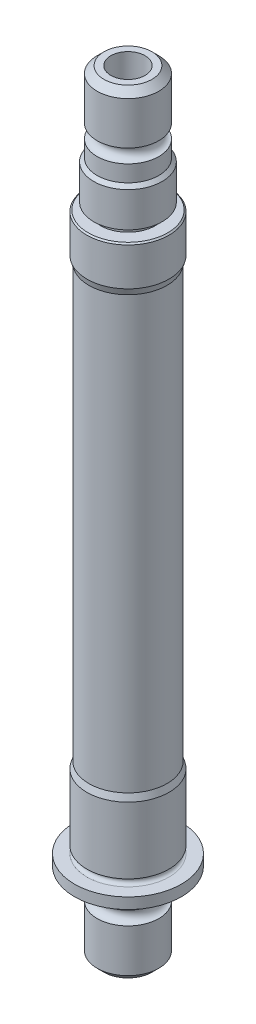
ISO-10303-21;
HEADER;
FILE_DESCRIPTION(('STEP AP214'),'2;1');
FILE_NAME('part.step','',(''),(''),'','','');
FILE_SCHEMA(('AUTOMOTIVE_DESIGN { 1 0 10303 214 1 1 1 1 }'));
ENDSEC;
DATA;
#1=APPLICATION_CONTEXT('core data for automotive mechanical design processes');
#2=APPLICATION_PROTOCOL_DEFINITION('international standard','automotive_design',2000,#1);
#3=PRODUCT_CONTEXT('',#1,'mechanical');
#4=PRODUCT('Part','Part','',(#3));
#5=PRODUCT_RELATED_PRODUCT_CATEGORY('part','',(#4));
#6=PRODUCT_DEFINITION_FORMATION('','',#4);
#7=PRODUCT_DEFINITION_CONTEXT('part definition',#1,'design');
#8=PRODUCT_DEFINITION('design','',#6,#7);
#9=PRODUCT_DEFINITION_SHAPE('','',#8);
#10=(LENGTH_UNIT() NAMED_UNIT(*) SI_UNIT(.MILLI.,.METRE.));
#11=(NAMED_UNIT(*) PLANE_ANGLE_UNIT() SI_UNIT($,.RADIAN.));
#12=(NAMED_UNIT(*) SI_UNIT($,.STERADIAN.) SOLID_ANGLE_UNIT());
#13=UNCERTAINTY_MEASURE_WITH_UNIT(LENGTH_MEASURE(1.E-05),#10,'distance_accuracy_value','');
#14=(GEOMETRIC_REPRESENTATION_CONTEXT(3) GLOBAL_UNCERTAINTY_ASSIGNED_CONTEXT((#13)) GLOBAL_UNIT_ASSIGNED_CONTEXT((#10,
#11,#12)) REPRESENTATION_CONTEXT('',''));
#15=CARTESIAN_POINT('',(0.,0.,0.));
#16=DIRECTION('',(0.,0.,1.));
#17=DIRECTION('',(1.,0.,0.));
#18=AXIS2_PLACEMENT_3D('',#15,#16,#17);
#19=CARTESIAN_POINT('',(0.,-110.700475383,0.));
#20=DIRECTION('',(0.,-1.,0.));
#21=DIRECTION('',(-0.809016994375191,0.,0.587785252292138));
#22=AXIS2_PLACEMENT_3D('',#19,#20,#21);
#23=TOROIDAL_SURFACE('',#22,2.7,0.2);
#24=CARTESIAN_POINT('',(2.7,-110.900475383,0.));
#25=CARTESIAN_POINT('',(2.69998718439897,-110.900475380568,0.0339576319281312));
#26=CARTESIAN_POINT('',(2.69934093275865,-110.900475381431,0.0679149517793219));
#27=CARTESIAN_POINT('',(2.69678441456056,-110.900475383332,0.135779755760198));
#28=CARTESIAN_POINT('',(2.69487423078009,-110.900475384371,0.169687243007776));
#29=CARTESIAN_POINT('',(2.68979282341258,-110.900475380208,0.237406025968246));
#30=CARTESIAN_POINT('',(2.68662165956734,-110.900475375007,0.271217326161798));
#31=CARTESIAN_POINT('',(2.67902054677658,-110.900475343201,0.338697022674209));
#32=CARTESIAN_POINT('',(2.67459063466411,-110.900475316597,0.372365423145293));
#33=CARTESIAN_POINT('',(2.6644873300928,-110.900475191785,0.439514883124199));
#34=CARTESIAN_POINT('',(2.6588139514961,-110.900475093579,0.472995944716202));
#35=CARTESIAN_POINT('',(2.64620429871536,-110.900474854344,0.539683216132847));
#36=CARTESIAN_POINT('',(2.63926936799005,-110.90047471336,0.572889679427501));
#37=CARTESIAN_POINT('',(2.62411229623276,-110.900474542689,0.639003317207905));
#38=CARTESIAN_POINT('',(2.6158903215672,-110.900474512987,0.67191052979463));
#39=CARTESIAN_POINT('',(2.59817524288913,-110.900474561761,0.737374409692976));
#40=CARTESIAN_POINT('',(2.58868235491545,-110.900474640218,0.769931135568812));
#41=CARTESIAN_POINT('',(2.56846105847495,-110.900474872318,0.834652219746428));
#42=CARTESIAN_POINT('',(2.55773291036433,-110.900475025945,0.866816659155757));
#43=CARTESIAN_POINT('',(2.53497416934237,-110.900475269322,0.930671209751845));
#44=CARTESIAN_POINT('',(2.52294390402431,-110.900475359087,0.962361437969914));
#45=CARTESIAN_POINT('',(2.50335857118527,-110.900475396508,1.01164643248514));
#46=CARTESIAN_POINT('',(2.49613389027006,-110.900475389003,1.02937463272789));
#47=CARTESIAN_POINT('',(2.47211322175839,-110.900475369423,1.08661051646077));
#48=CARTESIAN_POINT('',(2.45457747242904,-110.900475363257,1.12581274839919));
#49=CARTESIAN_POINT('',(2.42305802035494,-110.90047527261,1.1920107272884));
#50=CARTESIAN_POINT('',(2.40953329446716,-110.900475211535,1.21922662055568));
#51=CARTESIAN_POINT('',(2.38582648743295,-110.900475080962,1.26497562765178));
#52=CARTESIAN_POINT('',(2.37587952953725,-110.900475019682,1.28363088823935));
#53=CARTESIAN_POINT('',(2.34743468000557,-110.900474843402,1.33548563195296));
#54=CARTESIAN_POINT('',(2.32844470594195,-110.900474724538,1.36841727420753));
#55=CARTESIAN_POINT('',(2.29202354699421,-110.90047456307,1.42855465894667));
#56=CARTESIAN_POINT('',(2.27478598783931,-110.900474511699,1.45587815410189));
#57=CARTESIAN_POINT('',(2.23687758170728,-110.90047447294,1.51360086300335));
#58=CARTESIAN_POINT('',(2.21606107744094,-110.900474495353,1.54390463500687));
#59=CARTESIAN_POINT('',(2.17320018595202,-110.900474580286,1.60362550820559));
#60=CARTESIAN_POINT('',(2.15115593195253,-110.900474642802,1.63304270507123));
#61=CARTESIAN_POINT('',(2.10587119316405,-110.900474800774,1.69093526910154));
#62=CARTESIAN_POINT('',(2.08263086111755,-110.900474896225,1.7194107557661));
#63=CARTESIAN_POINT('',(2.03500765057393,-110.900475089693,1.77538329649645));
#64=CARTESIAN_POINT('',(2.01062493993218,-110.900475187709,1.80288049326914));
#65=CARTESIAN_POINT('',(1.9607133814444,-110.900475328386,1.85680544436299));
#66=CARTESIAN_POINT('',(1.93518472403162,-110.900475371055,1.88323337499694));
#67=CARTESIAN_POINT('',(1.89459071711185,-110.900475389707,1.92376260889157));
#68=CARTESIAN_POINT('',(1.87984561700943,-110.900475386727,1.93818778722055));
#69=CARTESIAN_POINT('',(1.83427961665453,-110.900475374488,1.98178267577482));
#70=CARTESIAN_POINT('',(1.80294261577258,-110.900475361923,2.01041867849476));
#71=CARTESIAN_POINT('',(1.74878944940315,-110.900475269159,2.05761691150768));
#72=CARTESIAN_POINT('',(1.72631315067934,-110.900475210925,2.07657127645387));
#73=CARTESIAN_POINT('',(1.68714630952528,-110.900475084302,2.10852052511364));
#74=CARTESIAN_POINT('',(1.67060210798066,-110.900475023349,2.12169515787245));
#75=CARTESIAN_POINT('',(1.6238921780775,-110.900474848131,2.15799325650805));
#76=CARTESIAN_POINT('',(1.59338123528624,-110.900474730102,2.18067546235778));
#77=CARTESIAN_POINT('',(1.53607639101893,-110.900474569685,2.22139513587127));
#78=CARTESIAN_POINT('',(1.50941374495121,-110.900474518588,2.23961804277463));
#79=CARTESIAN_POINT('',(1.45170708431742,-110.900474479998,2.27753004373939));
#80=CARTESIAN_POINT('',(1.42056708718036,-110.900474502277,2.29707337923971));
#81=CARTESIAN_POINT('',(1.35751208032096,-110.900474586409,2.33485796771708));
#82=CARTESIAN_POINT('',(1.32559715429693,-110.900474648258,2.35309936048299));
#83=CARTESIAN_POINT('',(1.26104469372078,-110.900474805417,2.38824548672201));
#84=CARTESIAN_POINT('',(1.22840725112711,-110.900474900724,2.40515038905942));
#85=CARTESIAN_POINT('',(1.16246811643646,-110.900475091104,2.43759831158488));
#86=CARTESIAN_POINT('',(1.12916652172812,-110.900475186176,2.45314152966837));
#87=CARTESIAN_POINT('',(1.06195221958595,-110.900475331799,2.48282946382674));
#88=CARTESIAN_POINT('',(1.02803961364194,-110.900475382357,2.49697440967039));
#89=CARTESIAN_POINT('',(0.962258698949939,-110.900475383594,2.52286427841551));
#90=CARTESIAN_POINT('',(0.930429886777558,-110.900475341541,2.53470981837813));
#91=CARTESIAN_POINT('',(0.866370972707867,-110.900475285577,2.55723547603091));
#92=CARTESIAN_POINT('',(0.834140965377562,-110.900475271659,2.56791586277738));
#93=CARTESIAN_POINT('',(0.769318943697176,-110.900475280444,2.58809508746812));
#94=CARTESIAN_POINT('',(0.736726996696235,-110.900475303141,2.59759414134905));
#95=CARTESIAN_POINT('',(0.671219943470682,-110.900475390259,2.61537840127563));
#96=CARTESIAN_POINT('',(0.638304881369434,-110.900475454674,2.62366377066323));
#97=CARTESIAN_POINT('',(0.572208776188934,-110.900475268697,2.63909703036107));
#98=CARTESIAN_POINT('',(0.539027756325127,-110.900475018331,2.64624501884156));
#99=CARTESIAN_POINT('',(0.488021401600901,-110.900474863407,2.65606100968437));
#100=CARTESIAN_POINT('',(0.470296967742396,-110.900474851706,2.65925725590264));
#101=CARTESIAN_POINT('',(0.414070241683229,-110.900474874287,2.66879628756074));
#102=CARTESIAN_POINT('',(0.375450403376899,-110.900474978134,2.67445993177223));
#103=CARTESIAN_POINT('',(0.309547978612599,-110.900475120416,2.68266610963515));
#104=CARTESIAN_POINT('',(0.28231727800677,-110.900475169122,2.68563576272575));
#105=CARTESIAN_POINT('',(0.230333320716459,-110.900475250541,2.69050427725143));
#106=CARTESIAN_POINT('',(0.205586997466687,-110.900475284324,2.69247739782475));
#107=CARTESIAN_POINT('',(0.142947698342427,-110.900475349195,2.69660572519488));
#108=CARTESIAN_POINT('',(0.105023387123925,-110.900475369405,2.6983053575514));
#109=CARTESIAN_POINT('',(0.044725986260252,-110.900475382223,2.69974873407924));
#110=CARTESIAN_POINT('',(0.0223633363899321,-110.900475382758,2.70000909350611));
#111=CARTESIAN_POINT('',(-0.0339474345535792,-110.900475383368,2.69998619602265));
#112=CARTESIAN_POINT('',(-0.0678963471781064,-110.900475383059,2.69935148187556));
#113=CARTESIAN_POINT('',(-0.135743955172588,-110.900475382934,2.69680972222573));
#114=CARTESIAN_POINT('',(-0.169642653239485,-110.900475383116,2.69490274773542));
#115=CARTESIAN_POINT('',(-0.23734436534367,-110.900475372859,2.6898283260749));
#116=CARTESIAN_POINT('',(-0.271147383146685,-110.90047536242,2.68666092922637));
#117=CARTESIAN_POINT('',(-0.338610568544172,-110.900475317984,2.67906562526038));
#118=CARTESIAN_POINT('',(-0.372270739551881,-110.900475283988,2.67463774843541));
#119=CARTESIAN_POINT('',(-0.43940360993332,-110.900475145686,2.66453700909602));
#120=CARTESIAN_POINT('',(-0.472876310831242,-110.90047504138,2.65886415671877));
#121=CARTESIAN_POINT('',(-0.539564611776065,-110.900474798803,2.64625212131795));
#122=CARTESIAN_POINT('',(-0.572780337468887,-110.900474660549,2.63931360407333));
#123=CARTESIAN_POINT('',(-0.638912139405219,-110.900474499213,2.62414962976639));
#124=CARTESIAN_POINT('',(-0.671828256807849,-110.900474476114,2.61592435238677));
#125=CARTESIAN_POINT('',(-0.737309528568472,-110.900474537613,2.59820252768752));
#126=CARTESIAN_POINT('',(-0.769874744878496,-110.90047462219,2.5887062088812));
#127=CARTESIAN_POINT('',(-0.83461246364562,-110.900474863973,2.56847809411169));
#128=CARTESIAN_POINT('',(-0.866785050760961,-110.900475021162,2.55774656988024));
#129=CARTESIAN_POINT('',(-0.930655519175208,-110.900475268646,2.53498096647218));
#130=CARTESIAN_POINT('',(-0.96235352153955,-110.900475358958,2.52294722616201));
#131=CARTESIAN_POINT('',(-1.01163995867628,-110.900475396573,2.50336104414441));
#132=CARTESIAN_POINT('',(-1.0293618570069,-110.900475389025,2.49613905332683));
#133=CARTESIAN_POINT('',(-1.08659373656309,-110.900475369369,2.47212065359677));
#134=CARTESIAN_POINT('',(-1.12579815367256,-110.900475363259,2.45458418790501));
#135=CARTESIAN_POINT('',(-1.19200247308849,-110.900475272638,2.42306211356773));
#136=CARTESIAN_POINT('',(-1.21922249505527,-110.900475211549,2.4095354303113));
#137=CARTESIAN_POINT('',(-1.26497555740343,-110.900475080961,2.3858265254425));
#138=CARTESIAN_POINT('',(-1.28363081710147,-110.900475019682,2.37587956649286));
#139=CARTESIAN_POINT('',(-1.3354855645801,-110.900474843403,2.34743472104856));
#140=CARTESIAN_POINT('',(-1.36841721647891,-110.900474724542,2.32844475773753));
#141=CARTESIAN_POINT('',(-1.4285545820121,-110.900474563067,2.29202357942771));
#142=CARTESIAN_POINT('',(-1.45587805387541,-110.900474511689,2.27478599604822));
#143=CARTESIAN_POINT('',(-1.51360083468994,-110.900474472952,2.23687766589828));
#144=CARTESIAN_POINT('',(-1.54390471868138,-110.900474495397,2.21606127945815));
#145=CARTESIAN_POINT('',(-1.60362529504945,-110.900474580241,2.17320007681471));
#146=CARTESIAN_POINT('',(-1.63304208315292,-110.900474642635,2.15115539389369));
#147=CARTESIAN_POINT('',(-1.690935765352,-110.900474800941,2.10587182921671));
#148=CARTESIAN_POINT('',(-1.71941277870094,-110.900474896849,2.0826330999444));
#149=CARTESIAN_POINT('',(-1.77538115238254,-110.900475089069,2.03500551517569));
#150=CARTESIAN_POINT('',(-1.80287265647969,-110.900475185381,2.0106168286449));
#151=CARTESIAN_POINT('',(-1.85681316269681,-110.900475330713,1.960721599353));
#152=CARTESIAN_POINT('',(-1.88326233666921,-110.90047537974,1.93521524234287));
#153=CARTESIAN_POINT('',(-1.9352109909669,-110.900475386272,1.88306428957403));
#154=CARTESIAN_POINT('',(-1.96070655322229,-110.900475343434,1.8564157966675));
#155=CARTESIAN_POINT('',(-2.01063605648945,-110.900475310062,1.80216287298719));
#156=CARTESIAN_POINT('',(-2.0350704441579,-110.900475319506,1.77455885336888));
#157=CARTESIAN_POINT('',(-2.0828177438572,-110.900475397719,1.71841461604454));
#158=CARTESIAN_POINT('',(-2.10613104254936,-110.900475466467,1.68987472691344));
#159=CARTESIAN_POINT('',(-2.14793288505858,-110.900475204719,1.63669416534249));
#160=CARTESIAN_POINT('',(-2.16658527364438,-110.9004749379,1.61218236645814));
#161=CARTESIAN_POINT('',(-2.19836831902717,-110.900474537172,1.56872831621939));
#162=CARTESIAN_POINT('',(-2.21170659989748,-110.900474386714,1.54993800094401));
#163=CARTESIAN_POINT('',(-2.24317918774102,-110.90047422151,1.50428243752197));
#164=CARTESIAN_POINT('',(-2.26105796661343,-110.900474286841,1.47724095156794));
#165=CARTESIAN_POINT('',(-2.30207127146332,-110.900474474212,1.41268484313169));
#166=CARTESIAN_POINT('',(-2.32478344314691,-110.900474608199,1.37490131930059));
#167=CARTESIAN_POINT('',(-2.37036952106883,-110.900474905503,1.29462405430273));
#168=CARTESIAN_POINT('',(-2.39305494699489,-110.900475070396,1.25202316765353));
#169=CARTESIAN_POINT('',(-2.43330903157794,-110.900475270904,1.17131035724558));
#170=CARTESIAN_POINT('',(-2.45115906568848,-110.900475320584,1.13333832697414));
#171=CARTESIAN_POINT('',(-2.48273418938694,-110.900475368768,1.06197597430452));
#172=CARTESIAN_POINT('',(-2.49668721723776,-110.90047537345,1.02868632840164));
#173=CARTESIAN_POINT('',(-2.52283014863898,-110.900475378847,0.962689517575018));
#174=CARTESIAN_POINT('',(-2.53506304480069,-110.900475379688,0.929999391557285));
#175=CARTESIAN_POINT('',(-2.5569822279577,-110.900475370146,0.867866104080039));
#176=CARTESIAN_POINT('',(-2.56680028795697,-110.900475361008,0.838469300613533));
#177=CARTESIAN_POINT('',(-2.58712908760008,-110.900475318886,0.773944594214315));
#178=CARTESIAN_POINT('',(-2.5974376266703,-110.900475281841,0.738752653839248));
#179=CARTESIAN_POINT('',(-2.61586982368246,-110.900475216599,0.670654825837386));
#180=CARTESIAN_POINT('',(-2.62409982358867,-110.900475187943,0.637777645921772));
#181=CARTESIAN_POINT('',(-2.63930752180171,-110.900475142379,0.571734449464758));
#182=CARTESIAN_POINT('',(-2.64628520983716,-110.900475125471,0.538568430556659));
#183=CARTESIAN_POINT('',(-2.65897646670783,-110.900475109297,0.471995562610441));
#184=CARTESIAN_POINT('',(-2.66469004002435,-110.90047511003,0.438588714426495));
#185=CARTESIAN_POINT('',(-2.67484522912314,-110.900475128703,0.371582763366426));
#186=CARTESIAN_POINT('',(-2.679286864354,-110.900475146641,0.337983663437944));
#187=CARTESIAN_POINT('',(-2.68689168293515,-110.900475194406,0.270642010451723));
#188=CARTESIAN_POINT('',(-2.69005490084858,-110.900475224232,0.236899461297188));
#189=CARTESIAN_POINT('',(-2.69509829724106,-110.900475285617,0.169319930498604));
#190=CARTESIAN_POINT('',(-2.69697852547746,-110.900475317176,0.135482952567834));
#191=CARTESIAN_POINT('',(-2.6994537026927,-110.900475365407,0.067763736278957));
#192=CARTESIAN_POINT('',(-2.70004871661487,-110.900475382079,0.0338815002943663));
#193=CARTESIAN_POINT('',(-2.7,-110.900475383,1.59317266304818E-07));
#194=B_SPLINE_CURVE_WITH_KNOTS('',3,(#24,#25,#26,#27,#28,#29,#30,#31,#32,#33,#34,#35,#36,#37,
#38,#39,#40,#41,#42,#43,#44,#45,#46,#47,#48,#49,#50,#51,#52,#53,#54,#55,#56,#57,#58,#59,#60,#61,
#62,#63,#64,#65,#66,#67,#68,#69,#70,#71,#72,#73,#74,#75,#76,#77,#78,#79,#80,#81,#82,#83,#84,#85,
#86,#87,#88,#89,#90,#91,#92,#93,#94,#95,#96,#97,#98,#99,#100,#101,#102,#103,#104,#105,#106,#107,
#108,#109,#110,#111,#112,#113,#114,#115,#116,#117,#118,#119,#120,#121,#122,#123,#124,#125,#126,
#127,#128,#129,#130,#131,#132,#133,#134,#135,#136,#137,#138,#139,#140,#141,#142,#143,#144,#145,
#146,#147,#148,#149,#150,#151,#152,#153,#154,#155,#156,#157,#158,#159,#160,#161,#162,#163,#164,
#165,#166,#167,#168,#169,#170,#171,#172,#173,#174,#175,#176,#177,#178,#179,#180,#181,#182,#183,
#184,#185,#186,#187,#188,#189,#190,#191,#192,#193),.UNSPECIFIED.,.F.,.F.,(4,2,2,2,2,2,2,2,2,2,2,
2,2,2,2,2,2,2,2,2,2,2,2,2,2,2,2,2,2,2,2,2,2,2,2,2,2,2,2,2,2,2,2,2,2,2,2,2,2,2,2,2,2,2,2,2,2,2,2,
2,2,2,2,2,2,2,2,2,2,2,2,2,2,2,2,2,2,2,2,2,2,2,2,2,4),(0.,0.10186688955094,0.20372710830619,
0.305582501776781,0.40743491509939,0.509286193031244,0.611029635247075,0.712759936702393,
0.814472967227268,0.916164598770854,1.0178307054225,1.07526067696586,1.20404107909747,
1.29519823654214,1.35861774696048,1.47262263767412,1.56952212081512,1.67978379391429,
1.79003352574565,1.90026921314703,2.01048875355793,2.12069004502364,2.18257082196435,
2.30986807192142,2.39805798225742,2.46150022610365,2.57551646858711,2.67238182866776,
2.78264325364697,2.89289282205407,3.00312843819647,3.11334800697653,3.22354943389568,
3.32541167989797,3.42725035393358,3.52907038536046,3.63087670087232,3.73267422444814,
3.78670169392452,3.90375691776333,3.98592176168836,4.06038798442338,4.17423659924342,
4.24132421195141,4.34316347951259,4.44499706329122,4.54682658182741,4.64865365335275,
4.75047989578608,4.85225272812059,4.95401136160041,5.05575172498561,5.15746974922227,
5.25916136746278,5.31657079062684,5.44535803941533,5.53652889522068,5.59994840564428,
5.71395329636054,5.81085277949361,5.92111445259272,6.03136418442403,6.14159987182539,
6.25181941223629,6.36202070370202,6.47263378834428,6.58319985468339,6.69372750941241,
6.78611374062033,6.85523410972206,6.95246407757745,7.08466276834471,7.22938424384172,
7.35521521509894,7.4634743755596,7.56816042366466,7.66112283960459,7.77110263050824,
7.87275352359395,7.97440525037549,8.07605661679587,8.1777064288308,8.27935349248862,
8.38099661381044,8.48263459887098),.UNSPECIFIED.);
#195=CARTESIAN_POINT('',(-2.70000000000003,-110.900475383,9.55903602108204E-08));
#196=VERTEX_POINT('',#195);
#197=CARTESIAN_POINT('',(2.69999999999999,-110.900475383,0.));
#198=VERTEX_POINT('',#197);
#199=EDGE_CURVE('E290',#196,#198,#194,.F.);
#200=ORIENTED_EDGE('',*,*,#199,.F.);
#201=CARTESIAN_POINT('',(0.,-110.900475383,0.));
#202=DIRECTION('',(0.,-1.,0.));
#203=DIRECTION('',(-1.,0.,0.));
#204=AXIS2_PLACEMENT_3D('',#201,#202,#203);
#205=CIRCLE('',#204,2.7);
#206=EDGE_CURVE('E292',#198,#196,#205,.F.);
#207=ORIENTED_EDGE('',*,*,#206,.F.);
#208=EDGE_LOOP('',(#200,#207));
#209=FACE_BOUND('',#208,.T.);
#210=CARTESIAN_POINT('',(0.,-110.700475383,0.));
#211=DIRECTION('',(0.,-1.,0.));
#212=DIRECTION('',(0.,0.,-1.));
#213=AXIS2_PLACEMENT_3D('',#210,#211,#212);
#214=CIRCLE('',#213,2.5);
#215=CARTESIAN_POINT('',(0.,-110.700475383,-2.5));
#216=VERTEX_POINT('',#215);
#217=EDGE_CURVE('E229',#216,#216,#214,.F.);
#218=ORIENTED_EDGE('',*,*,#217,.T.);
#219=EDGE_LOOP('',(#218));
#220=FACE_BOUND('',#219,.T.);
#221=ADVANCED_FACE('F16',(#209,#220),#23,.T.);
#222=CARTESIAN_POINT('',(3.23316150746,-111.100475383,0.));
#223=DIRECTION('',(-0.113022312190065,0.974116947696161,-0.195760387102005));
#224=DIRECTION('',(0.487058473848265,0.226044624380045,0.843610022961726));
#225=AXIS2_PLACEMENT_3D('',#222,#223,#224);
#226=SPHERICAL_SURFACE('',#225,0.2);
#227=CARTESIAN_POINT('',(3.23316150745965,-111.100475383,2.03938428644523E-13));
#228=DIRECTION('',(0.50000000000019,0.,0.866025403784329));
#229=DIRECTION('',(0.866025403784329,0.,-0.50000000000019));
#230=AXIS2_PLACEMENT_3D('',#227,#228,#229);
#231=CIRCLE('',#230,0.2);
#232=CARTESIAN_POINT('',(3.23316150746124,-110.900475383,-1.22814241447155E-12));
#233=VERTEX_POINT('',#232);
#234=CARTESIAN_POINT('',(3.40636658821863,-111.100475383,-0.100000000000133));
#235=VERTEX_POINT('',#234);
#236=EDGE_CURVE('E212',#233,#235,#231,.F.);
#237=ORIENTED_EDGE('',*,*,#236,.T.);
#238=CARTESIAN_POINT('',(3.23316150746,-111.100475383,0.));
#239=DIRECTION('',(0.,-1.,0.));
#240=DIRECTION('',(0.,0.,-1.));
#241=AXIS2_PLACEMENT_3D('',#238,#239,#240);
#242=CIRCLE('',#241,0.2);
#243=CARTESIAN_POINT('',(3.40636658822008,-111.100475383,0.100000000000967));
#244=VERTEX_POINT('',#243);
#245=EDGE_CURVE('E207',#235,#244,#242,.T.);
#246=ORIENTED_EDGE('',*,*,#245,.T.);
#247=CARTESIAN_POINT('',(3.23316150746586,-111.100475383,1.533278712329E-12));
#248=DIRECTION('',(-0.50000000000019,0.,0.866025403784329));
#249=DIRECTION('',(0.866025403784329,0.,0.50000000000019));
#250=AXIS2_PLACEMENT_3D('',#247,#248,#249);
#251=CIRCLE('',#250,0.2);
#252=EDGE_CURVE('E210',#244,#233,#251,.T.);
#253=ORIENTED_EDGE('',*,*,#252,.T.);
#254=EDGE_LOOP('',(#237,#246,#253));
#255=FACE_BOUND('',#254,.T.);
#256=ADVANCED_FACE('F209',(#255),#226,.F.);
#257=CARTESIAN_POINT('',(1.61658075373,-111.100475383,-2.8));
#258=DIRECTION('',(1.,0.,0.));
#259=DIRECTION('',(0.,0.,-1.));
#260=AXIS2_PLACEMENT_3D('',#257,#258,#259);
#261=SPHERICAL_SURFACE('',#260,0.2);
#262=CARTESIAN_POINT('',(1.61658075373,-111.100475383,-2.8));
#263=DIRECTION('',(0.,1.,0.));
#264=DIRECTION('',(0.,0.,1.));
#265=AXIS2_PLACEMENT_3D('',#262,#263,#264);
#266=CIRCLE('',#265,0.2);
#267=CARTESIAN_POINT('',(1.61658075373,-111.100475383,-3.));
#268=VERTEX_POINT('',#267);
#269=CARTESIAN_POINT('',(1.78978583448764,-111.100475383,-2.89999999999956));
#270=VERTEX_POINT('',#269);
#271=EDGE_CURVE('E675',#268,#270,#266,.F.);
#272=ORIENTED_EDGE('',*,*,#271,.T.);
#273=CARTESIAN_POINT('',(1.61658075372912,-111.100475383,-2.79999999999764));
#274=DIRECTION('',(0.50000000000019,0.,0.866025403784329));
#275=DIRECTION('',(0.866025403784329,0.,-0.50000000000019));
#276=AXIS2_PLACEMENT_3D('',#273,#274,#275);
#277=CIRCLE('',#276,0.2);
#278=CARTESIAN_POINT('',(1.61658075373,-110.900475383,-2.79999999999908));
#279=VERTEX_POINT('',#278);
#280=EDGE_CURVE('E683',#270,#279,#277,.T.);
#281=ORIENTED_EDGE('',*,*,#280,.T.);
#282=CARTESIAN_POINT('',(1.61658075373,-111.100475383,-2.8));
#283=DIRECTION('',(1.,0.,0.));
#284=DIRECTION('',(0.,0.,-1.));
#285=AXIS2_PLACEMENT_3D('',#282,#283,#284);
#286=CIRCLE('',#285,0.2);
#287=EDGE_CURVE('E668',#279,#268,#286,.F.);
#288=ORIENTED_EDGE('',*,*,#287,.T.);
#289=EDGE_LOOP('',(#272,#281,#288));
#290=FACE_BOUND('',#289,.T.);
#291=ADVANCED_FACE('F926',(#290),#261,.F.);
#292=CARTESIAN_POINT('',(-1.61658075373,-111.100475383,-2.8));
#293=DIRECTION('',(0.50000000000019,0.,-0.866025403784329));
#294=DIRECTION('',(-0.866025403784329,0.,-0.50000000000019));
#295=AXIS2_PLACEMENT_3D('',#292,#293,#294);
#296=SPHERICAL_SURFACE('',#295,0.2);
#297=CARTESIAN_POINT('',(-1.61658075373,-111.100475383,-2.8));
#298=DIRECTION('',(0.,1.,0.));
#299=DIRECTION('',(0.,0.,1.));
#300=AXIS2_PLACEMENT_3D('',#297,#298,#299);
#301=CIRCLE('',#300,0.2);
#302=CARTESIAN_POINT('',(-1.78978583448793,-111.100475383,-2.89999999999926));
#303=VERTEX_POINT('',#302);
#304=CARTESIAN_POINT('',(-1.61658075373,-111.100475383,-3.));
#305=VERTEX_POINT('',#304);
#306=EDGE_CURVE('E657',#303,#305,#301,.F.);
#307=ORIENTED_EDGE('',*,*,#306,.T.);
#308=CARTESIAN_POINT('',(-1.61658075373,-111.100475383,-2.8));
#309=DIRECTION('',(1.,0.,0.));
#310=DIRECTION('',(0.,0.,-1.));
#311=AXIS2_PLACEMENT_3D('',#308,#309,#310);
#312=CIRCLE('',#311,0.2);
#313=CARTESIAN_POINT('',(-1.61658075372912,-110.900475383,-2.8));
#314=VERTEX_POINT('',#313);
#315=EDGE_CURVE('E670',#305,#314,#312,.T.);
#316=ORIENTED_EDGE('',*,*,#315,.T.);
#317=CARTESIAN_POINT('',(-1.61658075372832,-111.100475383,-2.79999999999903));
#318=DIRECTION('',(0.50000000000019,0.,-0.866025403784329));
#319=DIRECTION('',(-0.866025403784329,0.,-0.50000000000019));
#320=AXIS2_PLACEMENT_3D('',#317,#318,#319);
#321=CIRCLE('',#320,0.2);
#322=EDGE_CURVE('E650',#314,#303,#321,.F.);
#323=ORIENTED_EDGE('',*,*,#322,.T.);
#324=EDGE_LOOP('',(#307,#316,#323));
#325=FACE_BOUND('',#324,.T.);
#326=ADVANCED_FACE('F928',(#325),#296,.F.);
#327=CARTESIAN_POINT('',(-3.23316150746,-111.100475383,0.));
#328=DIRECTION('',(-0.477659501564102,-0.295576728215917,0.827330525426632));
#329=DIRECTION('',(-0.147788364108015,0.955319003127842,0.255976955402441));
#330=AXIS2_PLACEMENT_3D('',#327,#328,#329);
#331=SPHERICAL_SURFACE('',#330,0.2);
#332=CARTESIAN_POINT('',(-3.23316150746,-111.100475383,0.));
#333=DIRECTION('',(0.,1.,0.));
#334=DIRECTION('',(0.,0.,1.));
#335=AXIS2_PLACEMENT_3D('',#332,#333,#334);
#336=CIRCLE('',#335,0.2);
#337=CARTESIAN_POINT('',(-3.40636658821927,-111.100475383,0.100000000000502));
#338=VERTEX_POINT('',#337);
#339=CARTESIAN_POINT('',(-3.40636658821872,-111.100475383,-0.100000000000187));
#340=VERTEX_POINT('',#339);
#341=EDGE_CURVE('E643',#338,#340,#336,.F.);
#342=ORIENTED_EDGE('',*,*,#341,.T.);
#343=CARTESIAN_POINT('',(-3.23316150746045,-111.100475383,1.58878986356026E-12));
#344=DIRECTION('',(0.50000000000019,0.,-0.866025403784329));
#345=DIRECTION('',(-0.866025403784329,0.,-0.50000000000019));
#346=AXIS2_PLACEMENT_3D('',#343,#344,#345);
#347=CIRCLE('',#346,0.2);
#348=CARTESIAN_POINT('',(-3.23316150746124,-110.900475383,1.22786083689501E-12));
#349=VERTEX_POINT('',#348);
#350=EDGE_CURVE('E652',#340,#349,#347,.T.);
#351=ORIENTED_EDGE('',*,*,#350,.T.);
#352=CARTESIAN_POINT('',(-3.23316150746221,-111.100475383,1.27296177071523E-12));
#353=DIRECTION('',(-0.50000000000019,0.,-0.866025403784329));
#354=DIRECTION('',(-0.866025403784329,0.,0.50000000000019));
#355=AXIS2_PLACEMENT_3D('',#352,#353,#354);
#356=CIRCLE('',#355,0.2);
#357=EDGE_CURVE('E905',#349,#338,#356,.F.);
#358=ORIENTED_EDGE('',*,*,#357,.T.);
#359=EDGE_LOOP('',(#342,#351,#358));
#360=FACE_BOUND('',#359,.T.);
#361=ADVANCED_FACE('F269',(#360),#331,.F.);
#362=CARTESIAN_POINT('',(0.,-110.900475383,0.));
#363=DIRECTION('',(0.,-1.,0.));
#364=DIRECTION('',(0.,0.,-1.));
#365=AXIS2_PLACEMENT_3D('',#362,#363,#364);
#366=PLANE('',#365);
#367=ORIENTED_EDGE('',*,*,#206,.T.);
#368=ORIENTED_EDGE('',*,*,#199,.T.);
#369=EDGE_LOOP('',(#367,#368));
#370=FACE_BOUND('',#369,.T.);
#371=DIRECTION('',(-0.50000000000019,0.,0.866025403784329));
#372=VECTOR('',#371,1.);
#373=CARTESIAN_POINT('',(2.81746931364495,-110.900475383,0.719999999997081));
#374=LINE('',#373,#372);
#375=CARTESIAN_POINT('',(1.61658075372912,-110.900475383,2.79999999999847));
#376=VERTEX_POINT('',#375);
#377=EDGE_CURVE('E228',#233,#376,#374,.T.);
#378=ORIENTED_EDGE('',*,*,#377,.T.);
#379=DIRECTION('',(1.,0.,0.));
#380=VECTOR('',#379,1.);
#381=CARTESIAN_POINT('',(0.,-110.900475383,2.8));
#382=LINE('',#381,#380);
#383=CARTESIAN_POINT('',(-1.61658075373,-110.900475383,2.79999999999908));
#384=VERTEX_POINT('',#383);
#385=EDGE_CURVE('E899',#376,#384,#382,.F.);
#386=ORIENTED_EDGE('',*,*,#385,.T.);
#387=DIRECTION('',(-0.50000000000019,0.,-0.866025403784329));
#388=VECTOR('',#387,1.);
#389=CARTESIAN_POINT('',(-2.82901631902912,-110.900475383,0.699999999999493));
#390=LINE('',#389,#388);
#391=EDGE_CURVE('E642',#384,#349,#390,.T.);
#392=ORIENTED_EDGE('',*,*,#391,.T.);
#393=DIRECTION('',(0.50000000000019,0.,-0.866025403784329));
#394=VECTOR('',#393,1.);
#395=CARTESIAN_POINT('',(-2.74818728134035,-110.900475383,-0.840000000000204));
#396=LINE('',#395,#394);
#397=EDGE_CURVE('E908',#349,#314,#396,.T.);
#398=ORIENTED_EDGE('',*,*,#397,.T.);
#399=DIRECTION('',(1.,0.,0.));
#400=VECTOR('',#399,1.);
#401=CARTESIAN_POINT('',(0.,-110.900475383,-2.8));
#402=LINE('',#401,#400);
#403=EDGE_CURVE('E661',#314,#279,#402,.T.);
#404=ORIENTED_EDGE('',*,*,#403,.T.);
#405=DIRECTION('',(0.50000000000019,0.,0.866025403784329));
#406=VECTOR('',#405,1.);
#407=CARTESIAN_POINT('',(2.74818728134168,-110.900475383,-0.84000000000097));
#408=LINE('',#407,#406);
#409=EDGE_CURVE('E679',#279,#233,#408,.T.);
#410=ORIENTED_EDGE('',*,*,#409,.T.);
#411=EDGE_LOOP('',(#378,#386,#392,#398,#404,#410));
#412=FACE_BOUND('',#411,.T.);
#413=ADVANCED_FACE('F264',(#370,#412),#366,.T.);
#414=CARTESIAN_POINT('',(-1.61658075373,-111.100475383,2.8));
#415=DIRECTION('',(0.226044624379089,0.974116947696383,0.));
#416=DIRECTION('',(-0.974116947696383,0.226044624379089,0.));
#417=AXIS2_PLACEMENT_3D('',#414,#415,#416);
#418=SPHERICAL_SURFACE('',#417,0.2);
#419=CARTESIAN_POINT('',(-1.61658075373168,-111.100475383,2.79999999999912));
#420=DIRECTION('',(-0.50000000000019,0.,-0.866025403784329));
#421=DIRECTION('',(-0.866025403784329,0.,0.50000000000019));
#422=AXIS2_PLACEMENT_3D('',#419,#420,#421);
#423=CIRCLE('',#422,0.2);
#424=CARTESIAN_POINT('',(-1.78978583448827,-111.100475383,2.89999999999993));
#425=VERTEX_POINT('',#424);
#426=EDGE_CURVE('E903',#425,#384,#423,.T.);
#427=ORIENTED_EDGE('',*,*,#426,.T.);
#428=CARTESIAN_POINT('',(-1.61658075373,-111.100475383,2.8));
#429=DIRECTION('',(1.,0.,0.));
#430=DIRECTION('',(0.,0.,-1.));
#431=AXIS2_PLACEMENT_3D('',#428,#429,#430);
#432=CIRCLE('',#431,0.2);
#433=CARTESIAN_POINT('',(-1.61658075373,-111.100475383,3.));
#434=VERTEX_POINT('',#433);
#435=EDGE_CURVE('E897',#384,#434,#432,.T.);
#436=ORIENTED_EDGE('',*,*,#435,.T.);
#437=CARTESIAN_POINT('',(-1.61658075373,-111.100475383,2.8));
#438=DIRECTION('',(0.,1.,0.));
#439=DIRECTION('',(0.,0.,1.));
#440=AXIS2_PLACEMENT_3D('',#437,#438,#439);
#441=CIRCLE('',#440,0.2);
#442=EDGE_CURVE('E635',#434,#425,#441,.F.);
#443=ORIENTED_EDGE('',*,*,#442,.T.);
#444=EDGE_LOOP('',(#427,#436,#443));
#445=FACE_BOUND('',#444,.T.);
#446=ADVANCED_FACE('F259',(#445),#418,.F.);
#447=CARTESIAN_POINT('',(1.61658075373,-111.100475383,2.8));
#448=DIRECTION('',(0.955319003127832,-0.295576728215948,0.));
#449=DIRECTION('',(0.295576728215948,0.955319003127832,0.));
#450=AXIS2_PLACEMENT_3D('',#447,#448,#449);
#451=SPHERICAL_SURFACE('',#450,0.2);
#452=CARTESIAN_POINT('',(1.61658075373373,-111.100475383,2.80000000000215));
#453=DIRECTION('',(-0.50000000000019,0.,0.866025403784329));
#454=DIRECTION('',(0.866025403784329,0.,0.50000000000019));
#455=AXIS2_PLACEMENT_3D('',#452,#453,#454);
#456=CIRCLE('',#455,0.2);
#457=CARTESIAN_POINT('',(1.78978583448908,-111.100475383,2.90000000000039));
#458=VERTEX_POINT('',#457);
#459=EDGE_CURVE('E218',#376,#458,#456,.F.);
#460=ORIENTED_EDGE('',*,*,#459,.T.);
#461=CARTESIAN_POINT('',(1.61658075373,-111.100475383,2.8));
#462=DIRECTION('',(0.,-1.,0.));
#463=DIRECTION('',(0.,0.,-1.));
#464=AXIS2_PLACEMENT_3D('',#461,#462,#463);
#465=CIRCLE('',#464,0.2);
#466=CARTESIAN_POINT('',(1.61658075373,-111.100475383,3.));
#467=VERTEX_POINT('',#466);
#468=EDGE_CURVE('E627',#458,#467,#465,.T.);
#469=ORIENTED_EDGE('',*,*,#468,.T.);
#470=CARTESIAN_POINT('',(1.61658075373,-111.100475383,2.8));
#471=DIRECTION('',(1.,0.,0.));
#472=DIRECTION('',(0.,0.,-1.));
#473=AXIS2_PLACEMENT_3D('',#470,#471,#472);
#474=CIRCLE('',#473,0.2);
#475=EDGE_CURVE('E634',#467,#376,#474,.F.);
#476=ORIENTED_EDGE('',*,*,#475,.T.);
#477=EDGE_LOOP('',(#460,#469,#476));
#478=FACE_BOUND('',#477,.T.);
#479=ADVANCED_FACE('F254',(#478),#451,.F.);
#480=CARTESIAN_POINT('',(0.,-56.7904753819,0.));
#481=DIRECTION('',(0.,-1.,0.));
#482=DIRECTION('',(0.,0.,-1.));
#483=AXIS2_PLACEMENT_3D('',#480,#481,#482);
#484=CYLINDRICAL_SURFACE('',#483,2.5);
#485=CARTESIAN_POINT('',(0.,-1.00047538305,0.));
#486=DIRECTION('',(0.,-1.,0.));
#487=DIRECTION('',(0.,0.,-1.));
#488=AXIS2_PLACEMENT_3D('',#485,#486,#487);
#489=CIRCLE('',#488,2.5);
#490=CARTESIAN_POINT('',(0.,-1.00047538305,-2.5));
#491=VERTEX_POINT('',#490);
#492=EDGE_CURVE('E243',#491,#491,#489,.T.);
#493=ORIENTED_EDGE('',*,*,#492,.F.);
#494=EDGE_LOOP('',(#493));
#495=FACE_BOUND('',#494,.T.);
#496=ORIENTED_EDGE('',*,*,#217,.F.);
#497=EDGE_LOOP('',(#496));
#498=FACE_BOUND('',#497,.T.);
#499=ADVANCED_FACE('F258',(#495,#498),#484,.F.);
#500=CARTESIAN_POINT('',(2.81746931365,-111.100475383,0.72));
#501=DIRECTION('',(-0.50000000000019,0.,0.866025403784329));
#502=DIRECTION('',(0.866025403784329,0.,0.50000000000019));
#503=AXIS2_PLACEMENT_3D('',#500,#501,#502);
#504=CYLINDRICAL_SURFACE('',#503,0.2);
#505=ORIENTED_EDGE('',*,*,#377,.F.);
#506=ORIENTED_EDGE('',*,*,#252,.F.);
#507=DIRECTION('',(-0.50000000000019,0.,0.866025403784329));
#508=VECTOR('',#507,1.);
#509=CARTESIAN_POINT('',(3.46410161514,-111.100475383,0.));
#510=LINE('',#509,#508);
#511=EDGE_CURVE('E226',#458,#244,#510,.F.);
#512=ORIENTED_EDGE('',*,*,#511,.F.);
#513=ORIENTED_EDGE('',*,*,#459,.F.);
#514=EDGE_LOOP('',(#505,#506,#512,#513));
#515=FACE_BOUND('',#514,.T.);
#516=ADVANCED_FACE('F223',(#515),#504,.F.);
#517=CARTESIAN_POINT('',(3.23316150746,-112.399232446,0.));
#518=DIRECTION('',(0.,-1.,0.));
#519=DIRECTION('',(0.,0.,-1.));
#520=AXIS2_PLACEMENT_3D('',#517,#518,#519);
#521=CYLINDRICAL_SURFACE('',#520,0.2);
#522=DIRECTION('',(0.,1.,0.));
#523=VECTOR('',#522,1.);
#524=CARTESIAN_POINT('',(3.40636658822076,-113.900475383,0.100000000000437));
#525=LINE('',#524,#523);
#526=CARTESIAN_POINT('',(3.40636658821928,-113.700475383,0.0999999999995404));
#527=VERTEX_POINT('',#526);
#528=EDGE_CURVE('E232',#244,#527,#525,.F.);
#529=ORIENTED_EDGE('',*,*,#528,.F.);
#530=ORIENTED_EDGE('',*,*,#245,.F.);
#531=DIRECTION('',(0.,1.,0.));
#532=VECTOR('',#531,1.);
#533=CARTESIAN_POINT('',(3.40636658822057,-113.900475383,-0.10000000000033));
#534=LINE('',#533,#532);
#535=CARTESIAN_POINT('',(3.40636658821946,-113.700475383,-0.0999999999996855));
#536=VERTEX_POINT('',#535);
#537=EDGE_CURVE('E237',#536,#235,#534,.T.);
#538=ORIENTED_EDGE('',*,*,#537,.F.);
#539=CARTESIAN_POINT('',(3.23316150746,-113.700475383,0.));
#540=DIRECTION('',(0.,-1.,0.));
#541=DIRECTION('',(0.,0.,-1.));
#542=AXIS2_PLACEMENT_3D('',#539,#540,#541);
#543=CIRCLE('',#542,0.2);
#544=EDGE_CURVE('E217',#527,#536,#543,.F.);
#545=ORIENTED_EDGE('',*,*,#544,.F.);
#546=EDGE_LOOP('',(#529,#530,#538,#545));
#547=FACE_BOUND('',#546,.T.);
#548=ADVANCED_FACE('F233',(#547),#521,.F.);
#549=CARTESIAN_POINT('',(2.74818728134,-111.100475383,-0.84));
#550=DIRECTION('',(0.50000000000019,0.,0.866025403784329));
#551=DIRECTION('',(0.866025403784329,0.,-0.50000000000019));
#552=AXIS2_PLACEMENT_3D('',#549,#550,#551);
#553=CYLINDRICAL_SURFACE('',#552,0.2);
#554=ORIENTED_EDGE('',*,*,#280,.F.);
#555=DIRECTION('',(0.50000000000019,0.,0.866025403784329));
#556=VECTOR('',#555,1.);
#557=CARTESIAN_POINT('',(1.73205080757,-111.100475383,-3.));
#558=LINE('',#557,#556);
#559=EDGE_CURVE('E610',#235,#270,#558,.F.);
#560=ORIENTED_EDGE('',*,*,#559,.F.);
#561=ORIENTED_EDGE('',*,*,#236,.F.);
#562=ORIENTED_EDGE('',*,*,#409,.F.);
#563=EDGE_LOOP('',(#554,#560,#561,#562));
#564=FACE_BOUND('',#563,.T.);
#565=ADVANCED_FACE('F980',(#564),#553,.F.);
#566=CARTESIAN_POINT('',(1.61658075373,-112.400475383,-2.8));
#567=DIRECTION('',(0.,1.,0.));
#568=DIRECTION('',(0.,0.,1.));
#569=AXIS2_PLACEMENT_3D('',#566,#567,#568);
#570=CYLINDRICAL_SURFACE('',#569,0.2);
#571=DIRECTION('',(0.,1.,0.));
#572=VECTOR('',#571,1.);
#573=CARTESIAN_POINT('',(1.78978583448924,-113.900475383,-2.89999999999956));
#574=LINE('',#573,#572);
#575=CARTESIAN_POINT('',(1.78978583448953,-113.700475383,-2.89999999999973));
#576=VERTEX_POINT('',#575);
#577=EDGE_CURVE('E601',#270,#576,#574,.F.);
#578=ORIENTED_EDGE('',*,*,#577,.F.);
#579=ORIENTED_EDGE('',*,*,#271,.F.);
#580=DIRECTION('',(0.,1.,0.));
#581=VECTOR('',#580,1.);
#582=CARTESIAN_POINT('',(1.61658075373,-113.900475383,-3.));
#583=LINE('',#582,#581);
#584=CARTESIAN_POINT('',(1.61658075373,-113.700475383,-3.00000000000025));
#585=VERTEX_POINT('',#584);
#586=EDGE_CURVE('E597',#585,#268,#583,.T.);
#587=ORIENTED_EDGE('',*,*,#586,.F.);
#588=CARTESIAN_POINT('',(1.61658075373,-113.700475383,-2.8));
#589=DIRECTION('',(0.,1.,0.));
#590=DIRECTION('',(0.,0.,1.));
#591=AXIS2_PLACEMENT_3D('',#588,#589,#590);
#592=CIRCLE('',#591,0.2);
#593=EDGE_CURVE('E671',#576,#585,#592,.T.);
#594=ORIENTED_EDGE('',*,*,#593,.F.);
#595=EDGE_LOOP('',(#578,#579,#587,#594));
#596=FACE_BOUND('',#595,.T.);
#597=ADVANCED_FACE('F973',(#596),#570,.F.);
#598=CARTESIAN_POINT('',(0.,-111.100475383,-2.8));
#599=DIRECTION('',(1.,0.,0.));
#600=DIRECTION('',(0.,0.,-1.));
#601=AXIS2_PLACEMENT_3D('',#598,#599,#600);
#602=CYLINDRICAL_SURFACE('',#601,0.2);
#603=ORIENTED_EDGE('',*,*,#315,.F.);
#604=DIRECTION('',(1.,0.,0.));
#605=VECTOR('',#604,1.);
#606=CARTESIAN_POINT('',(-1.73205080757,-111.100475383,-3.));
#607=LINE('',#606,#605);
#608=EDGE_CURVE('E600',#268,#305,#607,.F.);
#609=ORIENTED_EDGE('',*,*,#608,.F.);
#610=ORIENTED_EDGE('',*,*,#287,.F.);
#611=ORIENTED_EDGE('',*,*,#403,.F.);
#612=EDGE_LOOP('',(#603,#609,#610,#611));
#613=FACE_BOUND('',#612,.T.);
#614=ADVANCED_FACE('F965',(#613),#602,.F.);
#615=CARTESIAN_POINT('',(-1.61658075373,-112.399232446,-2.8));
#616=DIRECTION('',(0.,1.,0.));
#617=DIRECTION('',(0.,0.,1.));
#618=AXIS2_PLACEMENT_3D('',#615,#616,#617);
#619=CYLINDRICAL_SURFACE('',#618,0.2);
#620=DIRECTION('',(0.,1.,0.));
#621=VECTOR('',#620,1.);
#622=CARTESIAN_POINT('',(-1.61658075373,-113.900475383,-3.));
#623=LINE('',#622,#621);
#624=CARTESIAN_POINT('',(-1.61658075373,-113.700475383,-3.));
#625=VERTEX_POINT('',#624);
#626=EDGE_CURVE('E594',#305,#625,#623,.F.);
#627=ORIENTED_EDGE('',*,*,#626,.F.);
#628=ORIENTED_EDGE('',*,*,#306,.F.);
#629=DIRECTION('',(0.,1.,0.));
#630=VECTOR('',#629,1.);
#631=CARTESIAN_POINT('',(-1.78978583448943,-113.900475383,-2.89999999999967));
#632=LINE('',#631,#630);
#633=CARTESIAN_POINT('',(-1.78978583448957,-113.700475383,-2.89999999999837));
#634=VERTEX_POINT('',#633);
#635=EDGE_CURVE('E591',#634,#303,#632,.T.);
#636=ORIENTED_EDGE('',*,*,#635,.F.);
#637=CARTESIAN_POINT('',(-1.61658075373,-113.700475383,-2.8));
#638=DIRECTION('',(0.,1.,0.));
#639=DIRECTION('',(0.,0.,1.));
#640=AXIS2_PLACEMENT_3D('',#637,#638,#639);
#641=CIRCLE('',#640,0.2);
#642=EDGE_CURVE('E653',#625,#634,#641,.T.);
#643=ORIENTED_EDGE('',*,*,#642,.F.);
#644=EDGE_LOOP('',(#627,#628,#636,#643));
#645=FACE_BOUND('',#644,.T.);
#646=ADVANCED_FACE('F1024',(#645),#619,.F.);
#647=CARTESIAN_POINT('',(-2.74818728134,-111.100475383,-0.84));
#648=DIRECTION('',(0.50000000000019,0.,-0.866025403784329));
#649=DIRECTION('',(-0.866025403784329,0.,-0.50000000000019));
#650=AXIS2_PLACEMENT_3D('',#647,#648,#649);
#651=CYLINDRICAL_SURFACE('',#650,0.2);
#652=ORIENTED_EDGE('',*,*,#350,.F.);
#653=DIRECTION('',(0.50000000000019,0.,-0.866025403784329));
#654=VECTOR('',#653,1.);
#655=CARTESIAN_POINT('',(-3.46410161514,-111.100475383,0.));
#656=LINE('',#655,#654);
#657=EDGE_CURVE('E588',#303,#340,#656,.F.);
#658=ORIENTED_EDGE('',*,*,#657,.F.);
#659=ORIENTED_EDGE('',*,*,#322,.F.);
#660=ORIENTED_EDGE('',*,*,#397,.F.);
#661=EDGE_LOOP('',(#652,#658,#659,#660));
#662=FACE_BOUND('',#661,.T.);
#663=ADVANCED_FACE('F1020',(#662),#651,.F.);
#664=CARTESIAN_POINT('',(-3.23316150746,-112.399232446,0.));
#665=DIRECTION('',(0.,1.,0.));
#666=DIRECTION('',(0.,0.,1.));
#667=AXIS2_PLACEMENT_3D('',#664,#665,#666);
#668=CYLINDRICAL_SURFACE('',#667,0.2);
#669=DIRECTION('',(0.,1.,0.));
#670=VECTOR('',#669,1.);
#671=CARTESIAN_POINT('',(-3.40636658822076,-113.900475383,-0.100000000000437));
#672=LINE('',#671,#670);
#673=CARTESIAN_POINT('',(-3.40636658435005,-113.700475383,-0.100000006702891));
#674=VERTEX_POINT('',#673);
#675=EDGE_CURVE('E575',#340,#674,#672,.F.);
#676=ORIENTED_EDGE('',*,*,#675,.F.);
#677=ORIENTED_EDGE('',*,*,#341,.F.);
#678=DIRECTION('',(0.,1.,0.));
#679=VECTOR('',#678,1.);
#680=CARTESIAN_POINT('',(-3.40636658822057,-113.900475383,0.10000000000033));
#681=LINE('',#680,#679);
#682=CARTESIAN_POINT('',(-3.40636658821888,-113.700475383,0.0999999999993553));
#683=VERTEX_POINT('',#682);
#684=EDGE_CURVE('E571',#683,#338,#681,.T.);
#685=ORIENTED_EDGE('',*,*,#684,.F.);
#686=CARTESIAN_POINT('',(-3.23316150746,-113.700475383,0.));
#687=DIRECTION('',(0.,1.,0.));
#688=DIRECTION('',(0.,0.,1.));
#689=AXIS2_PLACEMENT_3D('',#686,#687,#688);
#690=CIRCLE('',#689,0.2);
#691=EDGE_CURVE('E640',#674,#683,#690,.T.);
#692=ORIENTED_EDGE('',*,*,#691,.F.);
#693=EDGE_LOOP('',(#676,#677,#685,#692));
#694=FACE_BOUND('',#693,.T.);
#695=ADVANCED_FACE('F1017',(#694),#668,.F.);
#696=CARTESIAN_POINT('',(-2.82901631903,-111.100475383,0.7));
#697=DIRECTION('',(-0.50000000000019,0.,-0.866025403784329));
#698=DIRECTION('',(-0.866025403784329,0.,0.50000000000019));
#699=AXIS2_PLACEMENT_3D('',#696,#697,#698);
#700=CYLINDRICAL_SURFACE('',#699,0.2);
#701=DIRECTION('',(-0.50000000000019,0.,-0.866025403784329));
#702=VECTOR('',#701,1.);
#703=CARTESIAN_POINT('',(-1.73205080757,-111.100475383,3.));
#704=LINE('',#703,#702);
#705=EDGE_CURVE('E574',#338,#425,#704,.F.);
#706=ORIENTED_EDGE('',*,*,#705,.F.);
#707=ORIENTED_EDGE('',*,*,#357,.F.);
#708=ORIENTED_EDGE('',*,*,#391,.F.);
#709=ORIENTED_EDGE('',*,*,#426,.F.);
#710=EDGE_LOOP('',(#706,#707,#708,#709));
#711=FACE_BOUND('',#710,.T.);
#712=ADVANCED_FACE('F957',(#711),#700,.F.);
#713=CARTESIAN_POINT('',(-1.61658075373,-112.399232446,2.8));
#714=DIRECTION('',(0.,1.,0.));
#715=DIRECTION('',(0.,0.,1.));
#716=AXIS2_PLACEMENT_3D('',#713,#714,#715);
#717=CYLINDRICAL_SURFACE('',#716,0.2);
#718=DIRECTION('',(0.,1.,0.));
#719=VECTOR('',#718,1.);
#720=CARTESIAN_POINT('',(-1.78978583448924,-113.900475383,2.89999999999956));
#721=LINE('',#720,#719);
#722=CARTESIAN_POINT('',(-1.78978583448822,-113.700475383,2.89999999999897));
#723=VERTEX_POINT('',#722);
#724=EDGE_CURVE('E562',#425,#723,#721,.F.);
#725=ORIENTED_EDGE('',*,*,#724,.F.);
#726=ORIENTED_EDGE('',*,*,#442,.F.);
#727=DIRECTION('',(0.,1.,0.));
#728=VECTOR('',#727,1.);
#729=CARTESIAN_POINT('',(-1.61658075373,-113.900475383,3.));
#730=LINE('',#729,#728);
#731=CARTESIAN_POINT('',(-1.61658075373,-113.700475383,3.));
#732=VERTEX_POINT('',#731);
#733=EDGE_CURVE('E558',#732,#434,#730,.T.);
#734=ORIENTED_EDGE('',*,*,#733,.F.);
#735=CARTESIAN_POINT('',(-1.61658075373,-113.700475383,2.8));
#736=DIRECTION('',(0.,1.,0.));
#737=DIRECTION('',(0.,0.,1.));
#738=AXIS2_PLACEMENT_3D('',#735,#736,#737);
#739=CIRCLE('',#738,0.2);
#740=EDGE_CURVE('E632',#723,#732,#739,.T.);
#741=ORIENTED_EDGE('',*,*,#740,.F.);
#742=EDGE_LOOP('',(#725,#726,#734,#741));
#743=FACE_BOUND('',#742,.T.);
#744=ADVANCED_FACE('F953',(#743),#717,.F.);
#745=CARTESIAN_POINT('',(0.,-111.100475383,2.8));
#746=DIRECTION('',(1.,0.,0.));
#747=DIRECTION('',(0.,0.,-1.));
#748=AXIS2_PLACEMENT_3D('',#745,#746,#747);
#749=CYLINDRICAL_SURFACE('',#748,0.2);
#750=ORIENTED_EDGE('',*,*,#435,.F.);
#751=ORIENTED_EDGE('',*,*,#385,.F.);
#752=ORIENTED_EDGE('',*,*,#475,.F.);
#753=DIRECTION('',(-1.,0.,0.));
#754=VECTOR('',#753,1.);
#755=CARTESIAN_POINT('',(1.73205080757,-111.100475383,3.));
#756=LINE('',#755,#754);
#757=EDGE_CURVE('E561',#434,#467,#756,.F.);
#758=ORIENTED_EDGE('',*,*,#757,.F.);
#759=EDGE_LOOP('',(#750,#751,#752,#758));
#760=FACE_BOUND('',#759,.T.);
#761=ADVANCED_FACE('F939',(#760),#749,.F.);
#762=CARTESIAN_POINT('',(1.61658075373,-112.399232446,2.8));
#763=DIRECTION('',(0.,-1.,0.));
#764=DIRECTION('',(0.,0.,-1.));
#765=AXIS2_PLACEMENT_3D('',#762,#763,#764);
#766=CYLINDRICAL_SURFACE('',#765,0.2);
#767=DIRECTION('',(0.,1.,0.));
#768=VECTOR('',#767,1.);
#769=CARTESIAN_POINT('',(1.61658075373,-113.900475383,3.));
#770=LINE('',#769,#768);
#771=CARTESIAN_POINT('',(1.61658075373,-113.700475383,3.));
#772=VERTEX_POINT('',#771);
#773=EDGE_CURVE('E565',#467,#772,#770,.F.);
#774=ORIENTED_EDGE('',*,*,#773,.F.);
#775=ORIENTED_EDGE('',*,*,#468,.F.);
#776=DIRECTION('',(0.,1.,0.));
#777=VECTOR('',#776,1.);
#778=CARTESIAN_POINT('',(1.78978583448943,-113.900475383,2.89999999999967));
#779=LINE('',#778,#777);
#780=CARTESIAN_POINT('',(1.78978579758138,-113.700475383,2.90000006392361));
#781=VERTEX_POINT('',#780);
#782=EDGE_CURVE('E241',#781,#458,#779,.T.);
#783=ORIENTED_EDGE('',*,*,#782,.F.);
#784=CARTESIAN_POINT('',(1.61658075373,-113.700475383,2.8));
#785=DIRECTION('',(0.,-1.,0.));
#786=DIRECTION('',(0.,0.,-1.));
#787=AXIS2_PLACEMENT_3D('',#784,#785,#786);
#788=CIRCLE('',#787,0.2);
#789=EDGE_CURVE('E625',#772,#781,#788,.F.);
#790=ORIENTED_EDGE('',*,*,#789,.F.);
#791=EDGE_LOOP('',(#774,#775,#783,#790));
#792=FACE_BOUND('',#791,.T.);
#793=ADVANCED_FACE('F944',(#792),#766,.F.);
#794=CARTESIAN_POINT('',(0.,-1.00047538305,3.5));
#795=DIRECTION('',(0.,1.,0.));
#796=DIRECTION('',(0.,0.,1.));
#797=AXIS2_PLACEMENT_3D('',#794,#795,#796);
#798=PLANE('',#797);
#799=ORIENTED_EDGE('',*,*,#492,.T.);
#800=EDGE_LOOP('',(#799));
#801=FACE_BOUND('',#800,.T.);
#802=CARTESIAN_POINT('',(0.,-1.00047538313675,0.));
#803=DIRECTION('',(0.,-1.,0.));
#804=DIRECTION('',(0.,0.,-1.));
#805=AXIS2_PLACEMENT_3D('',#802,#803,#804);
#806=CIRCLE('',#805,3.49999999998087);
#807=CARTESIAN_POINT('',(0.,-1.00047538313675,-3.49999999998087));
#808=VERTEX_POINT('',#807);
#809=EDGE_CURVE('E568',#808,#808,#806,.T.);
#810=ORIENTED_EDGE('',*,*,#809,.F.);
#811=EDGE_LOOP('',(#810));
#812=FACE_BOUND('',#811,.T.);
#813=ADVANCED_FACE('F1000',(#801,#812),#798,.T.);
#814=CARTESIAN_POINT('',(3.46410161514,-113.900475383,0.));
#815=DIRECTION('',(-0.866025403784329,0.,-0.50000000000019));
#816=DIRECTION('',(-0.50000000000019,0.,0.866025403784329));
#817=AXIS2_PLACEMENT_3D('',#814,#815,#816);
#818=PLANE('',#817);
#819=ORIENTED_EDGE('',*,*,#528,.T.);
#820=DIRECTION('',(-0.50000000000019,0.,0.866025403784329));
#821=VECTOR('',#820,1.);
#822=CARTESIAN_POINT('',(2.70980762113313,-113.700475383,1.30647552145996));
#823=LINE('',#822,#821);
#824=EDGE_CURVE('E547',#781,#527,#823,.F.);
#825=ORIENTED_EDGE('',*,*,#824,.F.);
#826=ORIENTED_EDGE('',*,*,#782,.T.);
#827=ORIENTED_EDGE('',*,*,#511,.T.);
#828=EDGE_LOOP('',(#819,#825,#826,#827));
#829=FACE_BOUND('',#828,.T.);
#830=ADVANCED_FACE('F239',(#829),#818,.T.);
#831=CARTESIAN_POINT('',(1.73205080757,-113.900475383,-3.));
#832=DIRECTION('',(-0.866025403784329,0.,0.50000000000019));
#833=DIRECTION('',(0.50000000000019,0.,0.866025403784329));
#834=AXIS2_PLACEMENT_3D('',#831,#832,#833);
#835=PLANE('',#834);
#836=ORIENTED_EDGE('',*,*,#577,.T.);
#837=DIRECTION('',(0.50000000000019,0.,0.866025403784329));
#838=VECTOR('',#837,1.);
#839=CARTESIAN_POINT('',(2.75755067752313,-113.700475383,-1.22378212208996));
#840=LINE('',#839,#838);
#841=EDGE_CURVE('E535',#536,#576,#840,.F.);
#842=ORIENTED_EDGE('',*,*,#841,.F.);
#843=ORIENTED_EDGE('',*,*,#537,.T.);
#844=ORIENTED_EDGE('',*,*,#559,.T.);
#845=EDGE_LOOP('',(#836,#842,#843,#844));
#846=FACE_BOUND('',#845,.T.);
#847=ADVANCED_FACE('F978',(#846),#835,.T.);
#848=CARTESIAN_POINT('',(-1.73205080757,-113.900475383,-3.));
#849=DIRECTION('',(0.,0.,1.));
#850=DIRECTION('',(1.,0.,0.));
#851=AXIS2_PLACEMENT_3D('',#848,#849,#850);
#852=PLANE('',#851);
#853=ORIENTED_EDGE('',*,*,#626,.T.);
#854=DIRECTION('',(1.,0.,0.));
#855=VECTOR('',#854,1.);
#856=CARTESIAN_POINT('',(-0.0397858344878,-113.700475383,-3.));
#857=LINE('',#856,#855);
#858=EDGE_CURVE('E523',#585,#625,#857,.F.);
#859=ORIENTED_EDGE('',*,*,#858,.F.);
#860=ORIENTED_EDGE('',*,*,#586,.T.);
#861=ORIENTED_EDGE('',*,*,#608,.T.);
#862=EDGE_LOOP('',(#853,#859,#860,#861));
#863=FACE_BOUND('',#862,.T.);
#864=ADVANCED_FACE('F1078',(#863),#852,.T.);
#865=CARTESIAN_POINT('',(-3.46410161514,-113.900475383,0.));
#866=DIRECTION('',(0.866025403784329,0.,0.50000000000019));
#867=DIRECTION('',(0.50000000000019,0.,-0.866025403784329));
#868=AXIS2_PLACEMENT_3D('',#865,#866,#867);
#869=PLANE('',#868);
#870=ORIENTED_EDGE('',*,*,#675,.T.);
#871=DIRECTION('',(0.50000000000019,0.,-0.866025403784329));
#872=VECTOR('',#871,1.);
#873=CARTESIAN_POINT('',(-2.75755062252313,-113.700475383,-1.22378221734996));
#874=LINE('',#873,#872);
#875=EDGE_CURVE('E510',#634,#674,#874,.F.);
#876=ORIENTED_EDGE('',*,*,#875,.F.);
#877=ORIENTED_EDGE('',*,*,#635,.T.);
#878=ORIENTED_EDGE('',*,*,#657,.T.);
#879=EDGE_LOOP('',(#870,#876,#877,#878));
#880=FACE_BOUND('',#879,.T.);
#881=ADVANCED_FACE('F1084',(#880),#869,.T.);
#882=CARTESIAN_POINT('',(-1.73205080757,-113.900475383,3.));
#883=DIRECTION('',(0.866025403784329,0.,-0.50000000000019));
#884=DIRECTION('',(-0.50000000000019,0.,-0.866025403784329));
#885=AXIS2_PLACEMENT_3D('',#882,#883,#884);
#886=PLANE('',#885);
#887=ORIENTED_EDGE('',*,*,#724,.T.);
#888=DIRECTION('',(-0.50000000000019,0.,-0.866025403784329));
#889=VECTOR('',#888,1.);
#890=CARTESIAN_POINT('',(-2.70980762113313,-113.700475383,1.30647552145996));
#891=LINE('',#890,#889);
#892=EDGE_CURVE('E498',#683,#723,#891,.F.);
#893=ORIENTED_EDGE('',*,*,#892,.F.);
#894=ORIENTED_EDGE('',*,*,#684,.T.);
#895=ORIENTED_EDGE('',*,*,#705,.T.);
#896=EDGE_LOOP('',(#887,#893,#894,#895));
#897=FACE_BOUND('',#896,.T.);
#898=ADVANCED_FACE('F1092',(#897),#886,.T.);
#899=CARTESIAN_POINT('',(1.73205080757,-113.900475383,3.));
#900=DIRECTION('',(0.,0.,-1.));
#901=DIRECTION('',(-1.,0.,0.));
#902=AXIS2_PLACEMENT_3D('',#899,#900,#901);
#903=PLANE('',#902);
#904=ORIENTED_EDGE('',*,*,#773,.T.);
#905=DIRECTION('',(-1.,0.,0.));
#906=VECTOR('',#905,1.);
#907=CARTESIAN_POINT('',(0.,-113.700475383,3.));
#908=LINE('',#907,#906);
#909=EDGE_CURVE('E486',#732,#772,#908,.F.);
#910=ORIENTED_EDGE('',*,*,#909,.F.);
#911=ORIENTED_EDGE('',*,*,#733,.T.);
#912=ORIENTED_EDGE('',*,*,#757,.T.);
#913=EDGE_LOOP('',(#904,#910,#911,#912));
#914=FACE_BOUND('',#913,.T.);
#915=ADVANCED_FACE('F880',(#914),#903,.T.);
#916=CARTESIAN_POINT('',(0.,-2.0004753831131,0.));
#917=DIRECTION('',(0.,-1.,0.));
#918=DIRECTION('',(0.,0.,-1.));
#919=AXIS2_PLACEMENT_3D('',#916,#917,#918);
#920=CONICAL_SURFACE('',#919,4.49999999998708,0.785398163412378);
#921=CARTESIAN_POINT('',(0.,-2.00047538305,0.));
#922=DIRECTION('',(0.,1.,0.));
#923=DIRECTION('',(0.,0.,1.));
#924=AXIS2_PLACEMENT_3D('',#921,#922,#923);
#925=CIRCLE('',#924,4.5);
#926=CARTESIAN_POINT('',(0.,-2.00047538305,4.5));
#927=VERTEX_POINT('',#926);
#928=EDGE_CURVE('E479',#927,#927,#925,.F.);
#929=ORIENTED_EDGE('',*,*,#928,.F.);
#930=EDGE_LOOP('',(#929));
#931=FACE_BOUND('',#930,.T.);
#932=ORIENTED_EDGE('',*,*,#809,.T.);
#933=EDGE_LOOP('',(#932));
#934=FACE_BOUND('',#933,.T.);
#935=ADVANCED_FACE('F876',(#931,#934),#920,.T.);
#936=CARTESIAN_POINT('',(2.88301270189,-113.700475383,1.40647552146));
#937=DIRECTION('',(-0.50000000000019,0.,0.866025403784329));
#938=DIRECTION('',(0.866025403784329,0.,0.50000000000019));
#939=AXIS2_PLACEMENT_3D('',#936,#937,#938);
#940=CYLINDRICAL_SURFACE('',#939,0.2);
#941=CARTESIAN_POINT('',(3.57957166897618,-113.700475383,0.199999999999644));
#942=DIRECTION('',(-0.50000000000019,0.,0.866025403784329));
#943=DIRECTION('',(0.866025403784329,0.,0.50000000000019));
#944=AXIS2_PLACEMENT_3D('',#941,#942,#943);
#945=CIRCLE('',#944,0.2);
#946=CARTESIAN_POINT('',(3.51210553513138,-113.884679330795,0.16104840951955));
#947=VERTEX_POINT('',#946);
#948=EDGE_CURVE('E543',#527,#947,#945,.T.);
#949=ORIENTED_EDGE('',*,*,#948,.T.);
#950=CARTESIAN_POINT('',(3.51210553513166,-113.884679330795,0.161048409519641));
#951=CARTESIAN_POINT('',(3.50882967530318,-113.887155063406,0.178445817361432));
#952=CARTESIAN_POINT('',(3.50568217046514,-113.889368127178,0.195905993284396));
#953=CARTESIAN_POINT('',(3.49967974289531,-113.893230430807,0.230910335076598));
#954=CARTESIAN_POINT('',(3.49682437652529,-113.894880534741,0.248454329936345));
#955=CARTESIAN_POINT('',(3.49143159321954,-113.897586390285,0.283639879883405));
#956=CARTESIAN_POINT('',(3.48889420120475,-113.898642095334,0.301281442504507));
#957=CARTESIAN_POINT('',(3.48421003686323,-113.900082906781,0.33667069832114));
#958=CARTESIAN_POINT('',(3.48206387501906,-113.900466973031,0.354418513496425));
#959=CARTESIAN_POINT('',(3.48015363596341,-113.900475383,0.372197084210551));
#960=B_SPLINE_CURVE_WITH_KNOTS('',3,(#950,#951,#952,#953,#954,#955,#956,#957,#958,#959),
.UNSPECIFIED.,.F.,.F.,(4,2,2,2,4),(0.,0.0536252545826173,0.107167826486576,0.16071459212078,
0.214344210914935),.UNSPECIFIED.);
#961=CARTESIAN_POINT('',(3.48015363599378,-113.900475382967,0.372197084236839));
#962=VERTEX_POINT('',#961);
#963=EDGE_CURVE('E546',#947,#962,#960,.T.);
#964=ORIENTED_EDGE('',*,*,#963,.T.);
#965=DIRECTION('',(-0.500000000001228,0.,0.86602540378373));
#966=VECTOR('',#965,1.);
#967=CARTESIAN_POINT('',(3.48015363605,-113.900475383,0.372197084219));
#968=LINE('',#967,#966);
#969=CARTESIAN_POINT('',(2.06240894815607,-113.900475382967,2.8278029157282));
#970=VERTEX_POINT('',#969);
#971=EDGE_CURVE('E474',#962,#970,#968,.T.);
#972=ORIENTED_EDGE('',*,*,#971,.T.);
#973=CARTESIAN_POINT('',(2.06240894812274,-113.900475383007,2.82780291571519));
#974=CARTESIAN_POINT('',(2.04796736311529,-113.900466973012,2.83834652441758));
#975=CARTESIAN_POINT('',(2.0336703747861,-113.900082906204,2.8490790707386));
#976=CARTESIAN_POINT('',(2.00536444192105,-113.898642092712,2.87083032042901));
#977=CARTESIAN_POINT('',(1.99135508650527,-113.89758638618,2.8818485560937));
#978=CARTESIAN_POINT('',(1.96357987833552,-113.894880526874,2.90411163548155));
#979=CARTESIAN_POINT('',(1.94981400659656,-113.893230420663,2.91535646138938));
#980=CARTESIAN_POINT('',(1.92250055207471,-113.889368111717,2.93805690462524));
#981=CARTESIAN_POINT('',(1.90895333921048,-113.887155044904,2.94951282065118));
#982=CARTESIAN_POINT('',(1.89552466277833,-113.884679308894,2.96104851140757));
#983=B_SPLINE_CURVE_WITH_KNOTS('',3,(#973,#974,#975,#976,#977,#978,#979,#980,#981,#982),
.UNSPECIFIED.,.F.,.F.,(4,2,2,2,4),(0.,0.0536296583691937,0.107176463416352,0.160719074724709,
0.214344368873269),.UNSPECIFIED.);
#984=CARTESIAN_POINT('',(1.8955246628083,-113.884679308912,2.96104851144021));
#985=VERTEX_POINT('',#984);
#986=EDGE_CURVE('E553',#970,#985,#983,.T.);
#987=ORIENTED_EDGE('',*,*,#986,.T.);
#988=CARTESIAN_POINT('',(1.96299084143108,-113.700475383,3.00000012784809));
#989=DIRECTION('',(-0.50000000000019,0.,0.866025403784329));
#990=DIRECTION('',(0.866025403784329,0.,0.50000000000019));
#991=AXIS2_PLACEMENT_3D('',#988,#989,#990);
#992=CIRCLE('',#991,0.2);
#993=EDGE_CURVE('E550',#985,#781,#992,.F.);
#994=ORIENTED_EDGE('',*,*,#993,.T.);
#995=ORIENTED_EDGE('',*,*,#824,.T.);
#996=EDGE_LOOP('',(#949,#964,#972,#987,#994,#995));
#997=FACE_BOUND('',#996,.T.);
#998=ADVANCED_FACE('F879',(#997),#940,.T.);
#999=CARTESIAN_POINT('',(2.93075575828,-113.700475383,-1.32378212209));
#1000=DIRECTION('',(0.50000000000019,0.,0.866025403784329));
#1001=DIRECTION('',(0.866025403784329,0.,-0.50000000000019));
#1002=AXIS2_PLACEMENT_3D('',#999,#1000,#1001);
#1003=CYLINDRICAL_SURFACE('',#1002,0.2);
#1004=CARTESIAN_POINT('',(1.96299091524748,-113.700475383,-3.00000000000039));
#1005=DIRECTION('',(0.50000000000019,0.,0.866025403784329));
#1006=DIRECTION('',(0.866025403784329,0.,-0.50000000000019));
#1007=AXIS2_PLACEMENT_3D('',#1004,#1005,#1006);
#1008=CIRCLE('',#1007,0.2);
#1009=CARTESIAN_POINT('',(1.89552486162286,-113.884679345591,-2.96104834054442));
#1010=VERTEX_POINT('',#1009);
#1011=EDGE_CURVE('E531',#576,#1010,#1008,.T.);
#1012=ORIENTED_EDGE('',*,*,#1011,.T.);
#1013=CARTESIAN_POINT('',(1.89552486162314,-113.88467934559,-2.96104834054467));
#1014=CARTESIAN_POINT('',(1.90895352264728,-113.887155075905,-2.94951266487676));
#1015=CARTESIAN_POINT('',(1.92250071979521,-113.889368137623,-2.93805676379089));
#1016=CARTESIAN_POINT('',(1.94981414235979,-113.893230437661,-2.91535635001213));
#1017=CARTESIAN_POINT('',(1.96357999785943,-113.894880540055,-2.90411153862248));
#1018=CARTESIAN_POINT('',(1.99135517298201,-113.897586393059,-2.8818484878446));
#1019=CARTESIAN_POINT('',(2.00536451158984,-113.898642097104,-2.87083026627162));
#1020=CARTESIAN_POINT('',(2.03367041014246,-113.900082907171,-2.8490790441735));
#1021=CARTESIAN_POINT('',(2.04796738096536,-113.900466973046,-2.83834651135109));
#1022=CARTESIAN_POINT('',(2.06240894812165,-113.900475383,-2.82780291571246));
#1023=B_SPLINE_CURVE_WITH_KNOTS('',3,(#1013,#1014,#1015,#1016,#1017,#1018,#1019,#1020,#1021,
#1022),.UNSPECIFIED.,.F.,.F.,(4,2,2,2,4),(0.,0.0536252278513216,0.107167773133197,
0.160714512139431,0.214344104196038),.UNSPECIFIED.);
#1024=CARTESIAN_POINT('',(2.06240894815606,-113.900475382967,-2.8278029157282));
#1025=VERTEX_POINT('',#1024);
#1026=EDGE_CURVE('E534',#1010,#1025,#1023,.T.);
#1027=ORIENTED_EDGE('',*,*,#1026,.T.);
#1028=DIRECTION('',(0.500000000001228,0.,0.86602540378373));
#1029=VECTOR('',#1028,1.);
#1030=CARTESIAN_POINT('',(2.06240894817,-113.900475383,-2.82780291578));
#1031=LINE('',#1030,#1029);
#1032=CARTESIAN_POINT('',(3.48015363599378,-113.900475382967,-0.372197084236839));
#1033=VERTEX_POINT('',#1032);
#1034=EDGE_CURVE('E470',#1025,#1033,#1031,.T.);
#1035=ORIENTED_EDGE('',*,*,#1034,.T.);
#1036=CARTESIAN_POINT('',(3.48015363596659,-113.900475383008,-0.37219708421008));
#1037=CARTESIAN_POINT('',(3.48206387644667,-113.900466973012,-0.354418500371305));
#1038=CARTESIAN_POINT('',(3.48421004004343,-113.900082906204,-0.336670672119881));
#1039=CARTESIAN_POINT('',(3.48889420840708,-113.898642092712,-0.301281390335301));
#1040=CARTESIAN_POINT('',(3.49143160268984,-113.897586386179,-0.283639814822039));
#1041=CARTESIAN_POINT('',(3.49682439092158,-113.894880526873,-0.248454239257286));
#1042=CARTESIAN_POINT('',(3.49967975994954,-113.893230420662,-0.230910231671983));
#1043=CARTESIAN_POINT('',(3.50568219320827,-113.889368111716,-0.195905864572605));
#1044=CARTESIAN_POINT('',(3.50882970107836,-113.887155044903,-0.178445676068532));
#1045=CARTESIAN_POINT('',(3.51210556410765,-113.884679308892,-0.161048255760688));
#1046=B_SPLINE_CURVE_WITH_KNOTS('',3,(#1036,#1037,#1038,#1039,#1040,#1041,#1042,#1043,#1044,
#1045),.UNSPECIFIED.,.F.,.F.,(4,2,2,2,4),(0.,0.0536296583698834,0.107176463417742,
0.160719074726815,0.21434436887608),.UNSPECIFIED.);
#1047=CARTESIAN_POINT('',(3.51210556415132,-113.884679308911,-0.161048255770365));
#1048=VERTEX_POINT('',#1047);
#1049=EDGE_CURVE('E540',#1033,#1048,#1046,.T.);
#1050=ORIENTED_EDGE('',*,*,#1049,.T.);
#1051=CARTESIAN_POINT('',(3.57957166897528,-113.700475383,-0.199999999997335));
#1052=DIRECTION('',(-0.499999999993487,0.,-0.866025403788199));
#1053=DIRECTION('',(0.866025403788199,0.,-0.499999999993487));
#1054=AXIS2_PLACEMENT_3D('',#1051,#1052,#1053);
#1055=CIRCLE('',#1054,0.2);
#1056=EDGE_CURVE('E471',#536,#1048,#1055,.F.);
#1057=ORIENTED_EDGE('',*,*,#1056,.F.);
#1058=ORIENTED_EDGE('',*,*,#841,.T.);
#1059=EDGE_LOOP('',(#1012,#1027,#1035,#1050,#1057,#1058));
#1060=FACE_BOUND('',#1059,.T.);
#1061=ADVANCED_FACE('F1117',(#1060),#1003,.T.);
#1062=CARTESIAN_POINT('',(-0.0397858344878,-113.700475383,-3.2));
#1063=DIRECTION('',(1.,0.,0.));
#1064=DIRECTION('',(0.,0.,-1.));
#1065=AXIS2_PLACEMENT_3D('',#1062,#1063,#1064);
#1066=CYLINDRICAL_SURFACE('',#1065,0.2);
#1067=CARTESIAN_POINT('',(-1.61658075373,-113.700475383,-3.2));
#1068=DIRECTION('',(1.,0.,0.));
#1069=DIRECTION('',(0.,0.,-1.));
#1070=AXIS2_PLACEMENT_3D('',#1067,#1068,#1069);
#1071=CIRCLE('',#1070,0.2);
#1072=CARTESIAN_POINT('',(-1.61658065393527,-113.884679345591,-3.12209685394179));
#1073=VERTEX_POINT('',#1072);
#1074=EDGE_CURVE('E519',#625,#1073,#1071,.T.);
#1075=ORIENTED_EDGE('',*,*,#1074,.T.);
#1076=CARTESIAN_POINT('',(-1.61658065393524,-113.884679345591,-3.12209685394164));
#1077=CARTESIAN_POINT('',(-1.599876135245,-113.887155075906,-3.12795857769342));
#1078=CARTESIAN_POINT('',(-1.5831814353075,-113.889368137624,-3.1339628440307));
#1079=CARTESIAN_POINT('',(-1.54986558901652,-113.893230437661,-3.14626675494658));
#1080=CARTESIAN_POINT('',(-1.53324436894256,-113.894880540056,-3.15256592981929));
#1081=CARTESIAN_POINT('',(-1.50007641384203,-113.897586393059,-3.16548841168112));
#1082=CARTESIAN_POINT('',(-1.48352968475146,-113.898642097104,-3.17211174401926));
#1083=CARTESIAN_POINT('',(-1.45053962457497,-113.900082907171,-3.18574976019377));
#1084=CARTESIAN_POINT('',(-1.43409649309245,-113.900466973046,-3.1927650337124));
#1085=CARTESIAN_POINT('',(-1.41774468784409,-113.900475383,-3.19999999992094));
#1086=B_SPLINE_CURVE_WITH_KNOTS('',3,(#1076,#1077,#1078,#1079,#1080,#1081,#1082,#1083,#1084,
#1085),.UNSPECIFIED.,.F.,.F.,(4,2,2,2,4),(0.,0.0536252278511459,0.107167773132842,
0.160714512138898,0.214344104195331),.UNSPECIFIED.);
#1087=CARTESIAN_POINT('',(-1.41774468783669,-113.900475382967,-3.19999999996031));
#1088=VERTEX_POINT('',#1087);
#1089=EDGE_CURVE('E522',#1073,#1088,#1086,.T.);
#1090=ORIENTED_EDGE('',*,*,#1089,.T.);
#1091=DIRECTION('',(1.,0.,0.));
#1092=VECTOR('',#1091,1.);
#1093=CARTESIAN_POINT('',(0.,-113.900475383,-3.2));
#1094=LINE('',#1093,#1092);
#1095=CARTESIAN_POINT('',(1.41774468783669,-113.900475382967,-3.19999999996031));
#1096=VERTEX_POINT('',#1095);
#1097=EDGE_CURVE('E424',#1088,#1096,#1094,.T.);
#1098=ORIENTED_EDGE('',*,*,#1097,.T.);
#1099=CARTESIAN_POINT('',(1.41774468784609,-113.900475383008,-3.19999999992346));
#1100=CARTESIAN_POINT('',(1.43409650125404,-113.900466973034,-3.19276503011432));
#1101=CARTESIAN_POINT('',(1.45053964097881,-113.900082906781,-3.18574975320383));
#1102=CARTESIAN_POINT('',(1.48352971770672,-113.898642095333,-3.1721117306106));
#1103=CARTESIAN_POINT('',(1.50007645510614,-113.897586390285,-3.16548839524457));
#1104=CARTESIAN_POINT('',(1.53324442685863,-113.894880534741,-3.15256590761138));
#1105=CARTESIAN_POINT('',(1.54986565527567,-113.893230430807,-3.14626672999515));
#1106=CARTESIAN_POINT('',(1.58318151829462,-113.889368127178,-3.13396281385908));
#1107=CARTESIAN_POINT('',(1.59987622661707,-113.887155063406,-3.12795854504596));
#1108=CARTESIAN_POINT('',(1.61658075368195,-113.884679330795,-3.12209681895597));
#1109=B_SPLINE_CURVE_WITH_KNOTS('',3,(#1099,#1100,#1101,#1102,#1103,#1104,#1105,#1106,#1107,
#1108),.UNSPECIFIED.,.F.,.F.,(4,2,2,2,4),(0.,0.0536296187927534,0.107176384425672,
0.160718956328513,0.214344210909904),.UNSPECIFIED.);
#1110=CARTESIAN_POINT('',(1.61658075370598,-113.884679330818,-3.12209681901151));
#1111=VERTEX_POINT('',#1110);
#1112=EDGE_CURVE('E528',#1096,#1111,#1109,.T.);
#1113=ORIENTED_EDGE('',*,*,#1112,.T.);
#1114=CARTESIAN_POINT('',(1.61658075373,-113.700475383,-3.200000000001));
#1115=DIRECTION('',(-1.,0.,0.));
#1116=DIRECTION('',(0.,0.,-1.));
#1117=AXIS2_PLACEMENT_3D('',#1114,#1115,#1116);
#1118=CIRCLE('',#1117,0.2);
#1119=EDGE_CURVE('E427',#585,#1111,#1118,.F.);
#1120=ORIENTED_EDGE('',*,*,#1119,.F.);
#1121=ORIENTED_EDGE('',*,*,#858,.T.);
#1122=EDGE_LOOP('',(#1075,#1090,#1098,#1113,#1120,#1121));
#1123=FACE_BOUND('',#1122,.T.);
#1124=ADVANCED_FACE('F1124',(#1123),#1066,.T.);
#1125=CARTESIAN_POINT('',(-2.93075570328,-113.700475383,-1.32378221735));
#1126=DIRECTION('',(0.50000000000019,0.,-0.866025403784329));
#1127=DIRECTION('',(-0.866025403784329,0.,-0.50000000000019));
#1128=AXIS2_PLACEMENT_3D('',#1125,#1126,#1127);
#1129=CYLINDRICAL_SURFACE('',#1128,0.2);
#1130=CARTESIAN_POINT('',(-3.5795716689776,-113.700475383,-0.200000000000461));
#1131=DIRECTION('',(0.50000000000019,0.,-0.866025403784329));
#1132=DIRECTION('',(-0.866025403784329,0.,-0.50000000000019));
#1133=AXIS2_PLACEMENT_3D('',#1130,#1131,#1132);
#1134=CIRCLE('',#1133,0.2);
#1135=CARTESIAN_POINT('',(-3.51210551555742,-113.88467934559,-0.161048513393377));
#1136=VERTEX_POINT('',#1135);
#1137=EDGE_CURVE('E506',#674,#1136,#1134,.T.);
#1138=ORIENTED_EDGE('',*,*,#1137,.T.);
#1139=CARTESIAN_POINT('',(-3.5121055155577,-113.88467934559,-0.16104851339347));
#1140=CARTESIAN_POINT('',(-3.50882965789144,-113.887155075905,-0.178445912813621));
#1141=CARTESIAN_POINT('',(-3.50568215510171,-113.889368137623,-0.195906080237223));
#1142=CARTESIAN_POINT('',(-3.49967973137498,-113.893230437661,-0.230910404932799));
#1143=CARTESIAN_POINT('',(-3.49682436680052,-113.894880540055,-0.248454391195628));
#1144=CARTESIAN_POINT('',(-3.49143158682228,-113.897586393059,-0.283639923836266));
#1145=CARTESIAN_POINT('',(-3.48889419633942,-113.898642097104,-0.30128147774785));
#1146=CARTESIAN_POINT('',(-3.4842100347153,-113.900082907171,-0.336670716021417));
#1147=CARTESIAN_POINT('',(-3.48206387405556,-113.900466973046,-0.354418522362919));
#1148=CARTESIAN_POINT('',(-3.48015363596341,-113.900475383,-0.372197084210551));
#1149=B_SPLINE_CURVE_WITH_KNOTS('',3,(#1139,#1140,#1141,#1142,#1143,#1144,#1145,#1146,#1147,
#1148),.UNSPECIFIED.,.F.,.F.,(4,2,2,2,4),(0.,0.0536252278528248,0.107167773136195,
0.160714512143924,0.214344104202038),.UNSPECIFIED.);
#1150=CARTESIAN_POINT('',(-3.48015363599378,-113.900475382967,-0.372197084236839));
#1151=VERTEX_POINT('',#1150);
#1152=EDGE_CURVE('E509',#1136,#1151,#1149,.T.);
#1153=ORIENTED_EDGE('',*,*,#1152,.T.);
#1154=DIRECTION('',(0.500000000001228,0.,-0.86602540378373));
#1155=VECTOR('',#1154,1.);
#1156=CARTESIAN_POINT('',(-3.48015363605,-113.900475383,-0.372197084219));
#1157=LINE('',#1156,#1155);
#1158=CARTESIAN_POINT('',(-2.06240894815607,-113.900475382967,-2.8278029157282));
#1159=VERTEX_POINT('',#1158);
#1160=EDGE_CURVE('E419',#1151,#1159,#1157,.T.);
#1161=ORIENTED_EDGE('',*,*,#1160,.T.);
#1162=CARTESIAN_POINT('',(-2.06240894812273,-113.900475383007,-2.8278029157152));
#1163=CARTESIAN_POINT('',(-2.04796737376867,-113.900466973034,-2.83834651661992));
#1164=CARTESIAN_POINT('',(-2.03367039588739,-113.900082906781,-2.84907905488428));
#1165=CARTESIAN_POINT('',(-2.00536448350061,-113.898642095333,-2.87083028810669));
#1166=CARTESIAN_POINT('',(-1.99135513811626,-113.897586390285,-2.88184851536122));
#1167=CARTESIAN_POINT('',(-1.96357994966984,-113.894880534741,-2.90411157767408));
#1168=CARTESIAN_POINT('',(-1.94981408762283,-113.893230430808,-2.91535639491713));
#1169=CARTESIAN_POINT('',(-1.92250065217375,-113.889368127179,-2.93805682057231));
#1170=CARTESIAN_POINT('',(-1.90895344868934,-113.887155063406,-2.94951272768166));
#1171=CARTESIAN_POINT('',(-1.89552478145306,-113.884679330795,-2.96104840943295));
#1172=B_SPLINE_CURVE_WITH_KNOTS('',3,(#1162,#1163,#1164,#1165,#1166,#1167,#1168,#1169,#1170,
#1171),.UNSPECIFIED.,.F.,.F.,(4,2,2,2,4),(0.,0.0536296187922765,0.107176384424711,
0.160718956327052,0.214344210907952),.UNSPECIFIED.);
#1173=CARTESIAN_POINT('',(-1.89552478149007,-113.884679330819,-2.96104840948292));
#1174=VERTEX_POINT('',#1173);
#1175=EDGE_CURVE('E516',#1159,#1174,#1172,.T.);
#1176=ORIENTED_EDGE('',*,*,#1175,.T.);
#1177=CARTESIAN_POINT('',(-1.96299091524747,-113.700475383,-2.99999999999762));
#1178=DIRECTION('',(0.50000000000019,0.,-0.866025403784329));
#1179=DIRECTION('',(-0.866025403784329,0.,-0.50000000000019));
#1180=AXIS2_PLACEMENT_3D('',#1177,#1178,#1179);
#1181=CIRCLE('',#1180,0.2);
#1182=EDGE_CURVE('E513',#1174,#634,#1181,.F.);
#1183=ORIENTED_EDGE('',*,*,#1182,.T.);
#1184=ORIENTED_EDGE('',*,*,#875,.T.);
#1185=EDGE_LOOP('',(#1138,#1153,#1161,#1176,#1183,#1184));
#1186=FACE_BOUND('',#1185,.T.);
#1187=ADVANCED_FACE('F1132',(#1186),#1129,.T.);
#1188=CARTESIAN_POINT('',(-2.88301270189,-113.700475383,1.40647552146));
#1189=DIRECTION('',(-0.50000000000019,0.,-0.866025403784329));
#1190=DIRECTION('',(-0.866025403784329,0.,0.50000000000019));
#1191=AXIS2_PLACEMENT_3D('',#1188,#1189,#1190);
#1192=CYLINDRICAL_SURFACE('',#1191,0.2);
#1193=CARTESIAN_POINT('',(-1.96299091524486,-113.700475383,2.99999999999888));
#1194=DIRECTION('',(-0.50000000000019,0.,-0.866025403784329));
#1195=DIRECTION('',(-0.866025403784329,0.,0.50000000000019));
#1196=AXIS2_PLACEMENT_3D('',#1193,#1194,#1195);
#1197=CIRCLE('',#1196,0.2);
#1198=CARTESIAN_POINT('',(-1.89552478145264,-113.884679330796,2.96104840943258));
#1199=VERTEX_POINT('',#1198);
#1200=EDGE_CURVE('E494',#723,#1199,#1197,.T.);
#1201=ORIENTED_EDGE('',*,*,#1200,.T.);
#1202=CARTESIAN_POINT('',(-1.89552478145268,-113.884679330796,2.96104840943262));
#1203=CARTESIAN_POINT('',(-1.90895344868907,-113.887155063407,2.94951272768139));
#1204=CARTESIAN_POINT('',(-1.92250065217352,-113.889368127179,2.938056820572));
#1205=CARTESIAN_POINT('',(-1.94981408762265,-113.893230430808,2.91535639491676));
#1206=CARTESIAN_POINT('',(-1.96357994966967,-113.894880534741,2.90411157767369));
#1207=CARTESIAN_POINT('',(-1.9913551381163,-113.897586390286,2.88184851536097));
#1208=CARTESIAN_POINT('',(-2.00536448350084,-113.898642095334,2.8708302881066));
#1209=CARTESIAN_POINT('',(-2.03367039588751,-113.900082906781,2.8490790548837));
#1210=CARTESIAN_POINT('',(-2.04796737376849,-113.900466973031,2.8383465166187));
#1211=CARTESIAN_POINT('',(-2.06240894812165,-113.900475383,2.82780291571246));
#1212=B_SPLINE_CURVE_WITH_KNOTS('',3,(#1202,#1203,#1204,#1205,#1206,#1207,#1208,#1209,#1210,
#1211),.UNSPECIFIED.,.F.,.F.,(4,2,2,2,4),(0.,0.0536252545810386,0.107167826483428,
0.16071459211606,0.214344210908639),.UNSPECIFIED.);
#1213=CARTESIAN_POINT('',(-2.06240894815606,-113.900475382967,2.8278029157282));
#1214=VERTEX_POINT('',#1213);
#1215=EDGE_CURVE('E497',#1199,#1214,#1212,.T.);
#1216=ORIENTED_EDGE('',*,*,#1215,.T.);
#1217=DIRECTION('',(-0.500000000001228,0.,-0.86602540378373));
#1218=VECTOR('',#1217,1.);
#1219=CARTESIAN_POINT('',(-2.06240894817,-113.900475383,2.82780291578));
#1220=LINE('',#1219,#1218);
#1221=CARTESIAN_POINT('',(-3.48015363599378,-113.900475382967,0.372197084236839));
#1222=VERTEX_POINT('',#1221);
#1223=EDGE_CURVE('E415',#1214,#1222,#1220,.T.);
#1224=ORIENTED_EDGE('',*,*,#1223,.T.);
#1225=CARTESIAN_POINT('',(-3.48015363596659,-113.900475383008,0.372197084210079));
#1226=CARTESIAN_POINT('',(-3.48206387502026,-113.900466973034,0.354418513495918));
#1227=CARTESIAN_POINT('',(-3.48421003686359,-113.900082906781,0.336670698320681));
#1228=CARTESIAN_POINT('',(-3.48889420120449,-113.898642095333,0.301281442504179));
#1229=CARTESIAN_POINT('',(-3.49143159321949,-113.897586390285,0.283639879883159));
#1230=CARTESIAN_POINT('',(-3.49682437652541,-113.894880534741,0.248454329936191));
#1231=CARTESIAN_POINT('',(-3.49967974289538,-113.893230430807,0.230910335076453));
#1232=CARTESIAN_POINT('',(-3.50568217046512,-113.889368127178,0.195905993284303));
#1233=CARTESIAN_POINT('',(-3.5088296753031,-113.887155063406,0.178445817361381));
#1234=CARTESIAN_POINT('',(-3.51210553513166,-113.884679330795,0.16104840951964));
#1235=B_SPLINE_CURVE_WITH_KNOTS('',3,(#1225,#1226,#1227,#1228,#1229,#1230,#1231,#1232,#1233,
#1234),.UNSPECIFIED.,.F.,.F.,(4,2,2,2,4),(0.,0.0536296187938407,0.107176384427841,
0.160718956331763,0.214344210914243),.UNSPECIFIED.);
#1236=CARTESIAN_POINT('',(-3.51210553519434,-113.884679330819,0.161048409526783));
#1237=VERTEX_POINT('',#1236);
#1238=EDGE_CURVE('E503',#1222,#1237,#1235,.T.);
#1239=ORIENTED_EDGE('',*,*,#1238,.T.);
#1240=CARTESIAN_POINT('',(-3.57957166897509,-113.700475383,0.199999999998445));
#1241=DIRECTION('',(0.49999999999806,0.,0.866025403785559));
#1242=DIRECTION('',(-0.866025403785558,0.,0.499999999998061));
#1243=AXIS2_PLACEMENT_3D('',#1240,#1241,#1242);
#1244=CIRCLE('',#1243,0.2);
#1245=EDGE_CURVE('E416',#683,#1237,#1244,.F.);
#1246=ORIENTED_EDGE('',*,*,#1245,.F.);
#1247=ORIENTED_EDGE('',*,*,#892,.T.);
#1248=EDGE_LOOP('',(#1201,#1216,#1224,#1239,#1246,#1247));
#1249=FACE_BOUND('',#1248,.T.);
#1250=ADVANCED_FACE('F1140',(#1249),#1192,.T.);
#1251=CARTESIAN_POINT('',(0.,-113.700475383,3.2));
#1252=DIRECTION('',(-1.,0.,0.));
#1253=DIRECTION('',(0.,0.,1.));
#1254=AXIS2_PLACEMENT_3D('',#1251,#1252,#1253);
#1255=CYLINDRICAL_SURFACE('',#1254,0.2);
#1256=CARTESIAN_POINT('',(1.61658075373,-113.700475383,3.2));
#1257=DIRECTION('',(-1.,0.,0.));
#1258=DIRECTION('',(0.,0.,1.));
#1259=AXIS2_PLACEMENT_3D('',#1256,#1257,#1258);
#1260=CIRCLE('',#1259,0.2);
#1261=CARTESIAN_POINT('',(1.61658075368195,-113.884679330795,3.12209681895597));
#1262=VERTEX_POINT('',#1261);
#1263=EDGE_CURVE('E482',#772,#1262,#1260,.T.);
#1264=ORIENTED_EDGE('',*,*,#1263,.T.);
#1265=CARTESIAN_POINT('',(1.61658075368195,-113.884679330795,3.12209681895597));
#1266=CARTESIAN_POINT('',(1.59987622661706,-113.887155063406,3.12795854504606));
#1267=CARTESIAN_POINT('',(1.58318151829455,-113.889368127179,3.13396281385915));
#1268=CARTESIAN_POINT('',(1.54986565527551,-113.893230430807,3.14626672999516));
#1269=CARTESIAN_POINT('',(1.53324442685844,-113.894880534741,3.15256590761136));
#1270=CARTESIAN_POINT('',(1.50007645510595,-113.897586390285,3.16548839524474));
#1271=CARTESIAN_POINT('',(1.48352971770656,-113.898642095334,3.17211173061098));
#1272=CARTESIAN_POINT('',(1.45053964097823,-113.900082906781,3.18574975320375));
#1273=CARTESIAN_POINT('',(1.43409650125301,-113.900466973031,3.19276503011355));
#1274=CARTESIAN_POINT('',(1.41774468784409,-113.900475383,3.19999999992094));
#1275=B_SPLINE_CURVE_WITH_KNOTS('',3,(#1265,#1266,#1267,#1268,#1269,#1270,#1271,#1272,#1273,
#1274),.UNSPECIFIED.,.F.,.F.,(4,2,2,2,4),(0.,0.0536252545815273,0.107167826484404,
0.160714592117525,0.214344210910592),.UNSPECIFIED.);
#1276=CARTESIAN_POINT('',(1.41774468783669,-113.900475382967,3.19999999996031));
#1277=VERTEX_POINT('',#1276);
#1278=EDGE_CURVE('E485',#1262,#1277,#1275,.T.);
#1279=ORIENTED_EDGE('',*,*,#1278,.T.);
#1280=DIRECTION('',(1.,0.,0.));
#1281=VECTOR('',#1280,1.);
#1282=CARTESIAN_POINT('',(0.,-113.900475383,3.2));
#1283=LINE('',#1282,#1281);
#1284=CARTESIAN_POINT('',(-1.41774468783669,-113.900475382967,3.19999999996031));
#1285=VERTEX_POINT('',#1284);
#1286=EDGE_CURVE('E368',#1277,#1285,#1283,.F.);
#1287=ORIENTED_EDGE('',*,*,#1286,.T.);
#1288=CARTESIAN_POINT('',(-1.41774468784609,-113.900475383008,3.19999999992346));
#1289=CARTESIAN_POINT('',(-1.43409651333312,-113.900466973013,3.19276502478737));
#1290=CARTESIAN_POINT('',(-1.45053966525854,-113.900082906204,3.18574974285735));
#1291=CARTESIAN_POINT('',(-1.4835297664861,-113.898642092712,3.17211171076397));
#1292=CARTESIAN_POINT('',(-1.50007651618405,-113.89758638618,3.16548837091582));
#1293=CARTESIAN_POINT('',(-1.53324451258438,-113.894880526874,3.15256587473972));
#1294=CARTESIAN_POINT('',(-1.54986575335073,-113.893230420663,3.14626669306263));
#1295=CARTESIAN_POINT('',(-1.58318164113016,-113.889368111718,3.13396276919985));
#1296=CARTESIAN_POINT('',(-1.5998763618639,-113.887155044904,3.12795849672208));
#1297=CARTESIAN_POINT('',(-1.61658090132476,-113.884679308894,3.12209676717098));
#1298=B_SPLINE_CURVE_WITH_KNOTS('',3,(#1288,#1289,#1290,#1291,#1292,#1293,#1294,#1295,#1296,
#1297),.UNSPECIFIED.,.F.,.F.,(4,2,2,2,4),(0.,0.0536296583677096,0.107176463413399,
0.160719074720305,0.214344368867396),.UNSPECIFIED.);
#1299=CARTESIAN_POINT('',(-1.61658090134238,-113.884679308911,3.12209676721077));
#1300=VERTEX_POINT('',#1299);
#1301=EDGE_CURVE('E491',#1285,#1300,#1298,.T.);
#1302=ORIENTED_EDGE('',*,*,#1301,.T.);
#1303=CARTESIAN_POINT('',(-1.61658075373,-113.700475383,3.2));
#1304=DIRECTION('',(1.,0.,0.));
#1305=DIRECTION('',(0.,0.,1.));
#1306=AXIS2_PLACEMENT_3D('',#1303,#1304,#1305);
#1307=CIRCLE('',#1306,0.2);
#1308=EDGE_CURVE('E372',#732,#1300,#1307,.F.);
#1309=ORIENTED_EDGE('',*,*,#1308,.F.);
#1310=ORIENTED_EDGE('',*,*,#909,.T.);
#1311=EDGE_LOOP('',(#1264,#1279,#1287,#1302,#1309,#1310));
#1312=FACE_BOUND('',#1311,.T.);
#1313=ADVANCED_FACE('F873',(#1312),#1255,.T.);
#1314=CARTESIAN_POINT('',(0.,-57.450475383,0.));
#1315=DIRECTION('',(0.,1.,0.));
#1316=DIRECTION('',(0.,0.,1.));
#1317=AXIS2_PLACEMENT_3D('',#1314,#1315,#1316);
#1318=CYLINDRICAL_SURFACE('',#1317,4.5);
#1319=CARTESIAN_POINT('',(0.,-8.2569507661,0.));
#1320=DIRECTION('',(0.,1.,0.));
#1321=DIRECTION('',(0.479425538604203,0.,0.877582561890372));
#1322=AXIS2_PLACEMENT_3D('',#1319,#1320,#1321);
#1323=CIRCLE('',#1322,4.50000000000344);
#1324=CARTESIAN_POINT('',(2.15741492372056,-8.2569507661,3.94912152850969));
#1325=VERTEX_POINT('',#1324);
#1326=EDGE_CURVE('E371',#1325,#1325,#1323,.T.);
#1327=ORIENTED_EDGE('',*,*,#1326,.T.);
#1328=EDGE_LOOP('',(#1327));
#1329=FACE_BOUND('',#1328,.T.);
#1330=ORIENTED_EDGE('',*,*,#928,.T.);
#1331=EDGE_LOOP('',(#1330));
#1332=FACE_BOUND('',#1331,.T.);
#1333=ADVANCED_FACE('F870',(#1329,#1332),#1318,.T.);
#1334=CARTESIAN_POINT('',(0.,-113.900475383,0.));
#1335=DIRECTION('',(0.,1.,0.));
#1336=DIRECTION('',(0.,0.,1.));
#1337=AXIS2_PLACEMENT_3D('',#1334,#1335,#1336);
#1338=PLANE('',#1337);
#1339=CARTESIAN_POINT('',(0.,-113.900475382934,0.));
#1340=DIRECTION('',(0.,1.,0.));
#1341=DIRECTION('',(0.,0.,1.));
#1342=AXIS2_PLACEMENT_3D('',#1339,#1340,#1341);
#1343=CIRCLE('',#1342,3.49999999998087);
#1344=EDGE_CURVE('E457',#970,#962,#1343,.T.);
#1345=ORIENTED_EDGE('',*,*,#1344,.F.);
#1346=ORIENTED_EDGE('',*,*,#971,.F.);
#1347=EDGE_LOOP('',(#1345,#1346));
#1348=FACE_BOUND('',#1347,.T.);
#1349=ADVANCED_FACE('F464',(#1348),#1338,.F.);
#1350=CARTESIAN_POINT('',(3.23316150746,-113.700475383,0.));
#1351=DIRECTION('',(0.,1.,0.));
#1352=DIRECTION('',(0.527382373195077,0.,0.849628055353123));
#1353=AXIS2_PLACEMENT_3D('',#1350,#1351,#1352);
#1354=TOROIDAL_SURFACE('',#1353,0.4,0.2);
#1355=ORIENTED_EDGE('',*,*,#1056,.T.);
#1356=CARTESIAN_POINT('',(3.51210553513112,-113.884679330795,0.161048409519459));
#1357=CARTESIAN_POINT('',(3.51525249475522,-113.882294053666,0.144492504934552));
#1358=CARTESIAN_POINT('',(3.51813237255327,-113.880061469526,0.127834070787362));
#1359=CARTESIAN_POINT('',(3.52305231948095,-113.876202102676,0.0942825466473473));
#1360=CARTESIAN_POINT('',(3.52509012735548,-113.87457695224,0.0773889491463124));
#1361=CARTESIAN_POINT('',(3.52796900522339,-113.872273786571,0.0437895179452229));
#1362=CARTESIAN_POINT('',(3.52883475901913,-113.871576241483,0.0270874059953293));
#1363=CARTESIAN_POINT('',(3.52933804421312,-113.871171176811,-0.00632265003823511));
#1364=CARTESIAN_POINT('',(3.52897734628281,-113.871462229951,-0.023030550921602));
#1365=CARTESIAN_POINT('',(3.52686375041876,-113.873159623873,-0.0600219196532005));
#1366=CARTESIAN_POINT('',(3.52482015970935,-113.874798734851,-0.0802775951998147));
#1367=CARTESIAN_POINT('',(3.52072362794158,-113.878031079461,-0.110561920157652));
#1368=CARTESIAN_POINT('',(3.51917201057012,-113.879248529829,-0.12070926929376));
#1369=CARTESIAN_POINT('',(3.51581069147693,-113.881855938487,-0.140928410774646));
#1370=CARTESIAN_POINT('',(3.51400126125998,-113.883245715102,-0.151000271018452));
#1371=CARTESIAN_POINT('',(3.51210556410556,-113.884679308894,-0.161048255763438));
#1372=B_SPLINE_CURVE_WITH_KNOTS('',3,(#1356,#1357,#1358,#1359,#1360,#1361,#1362,#1363,#1364,
#1365,#1366,#1367,#1368,#1369,#1370,#1371),.UNSPECIFIED.,.F.,.F.,(4,2,2,2,2,2,2,4),(0.,
0.0511036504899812,0.102343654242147,0.152486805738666,0.202557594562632,0.263719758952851,
0.294728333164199,0.325704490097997),.UNSPECIFIED.);
#1373=EDGE_CURVE('E451',#947,#1048,#1372,.T.);
#1374=ORIENTED_EDGE('',*,*,#1373,.F.);
#1375=ORIENTED_EDGE('',*,*,#948,.F.);
#1376=ORIENTED_EDGE('',*,*,#544,.T.);
#1377=EDGE_LOOP('',(#1355,#1374,#1375,#1376));
#1378=FACE_BOUND('',#1377,.T.);
#1379=ADVANCED_FACE('F459',(#1378),#1354,.T.);
#1380=CARTESIAN_POINT('',(0.,-113.900475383,0.));
#1381=DIRECTION('',(0.,1.,0.));
#1382=DIRECTION('',(0.,0.,1.));
#1383=AXIS2_PLACEMENT_3D('',#1380,#1381,#1382);
#1384=PLANE('',#1383);
#1385=CARTESIAN_POINT('',(0.,-113.900475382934,0.));
#1386=DIRECTION('',(0.,1.,0.));
#1387=DIRECTION('',(0.,0.,1.));
#1388=AXIS2_PLACEMENT_3D('',#1385,#1386,#1387);
#1389=CIRCLE('',#1388,3.49999999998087);
#1390=EDGE_CURVE('E448',#1033,#1025,#1389,.T.);
#1391=ORIENTED_EDGE('',*,*,#1390,.F.);
#1392=ORIENTED_EDGE('',*,*,#1034,.F.);
#1393=EDGE_LOOP('',(#1391,#1392));
#1394=FACE_BOUND('',#1393,.T.);
#1395=ADVANCED_FACE('F437',(#1394),#1384,.F.);
#1396=CARTESIAN_POINT('',(1.61658075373,-113.700475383,-2.8));
#1397=DIRECTION('',(0.,1.,0.));
#1398=DIRECTION('',(0.906580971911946,0.,-0.422031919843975));
#1399=AXIS2_PLACEMENT_3D('',#1396,#1397,#1398);
#1400=TOROIDAL_SURFACE('',#1399,0.400000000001,0.2);
#1401=ORIENTED_EDGE('',*,*,#1119,.T.);
#1402=CARTESIAN_POINT('',(1.89552486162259,-113.884679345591,-2.96104834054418));
#1403=CARTESIAN_POINT('',(1.88276050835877,-113.882294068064,-2.97205164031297));
#1404=CARTESIAN_POINT('',(1.86977382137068,-113.880061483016,-2.98287490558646));
#1405=CARTESIAN_POINT('',(1.84317732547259,-113.876202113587,-3.00391146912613));
#1406=CARTESIAN_POINT('',(1.82956594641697,-113.874576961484,-3.01412306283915));
#1407=CARTESIAN_POINT('',(1.80190742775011,-113.872273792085,-3.03341596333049));
#1408=CARTESIAN_POINT('',(1.78787585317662,-113.871576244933,-3.04251678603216));
#1409=CARTESIAN_POINT('',(1.7591935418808,-113.871171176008,-3.0596576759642));
#1410=CARTESIAN_POINT('',(1.74454372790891,-113.871462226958,-3.06769925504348));
#1411=CARTESIAN_POINT('',(1.71145142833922,-113.873159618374,-3.08436453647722));
#1412=CARTESIAN_POINT('',(1.69288766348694,-113.874798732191,-3.09272259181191));
#1413=CARTESIAN_POINT('',(1.66461234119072,-113.878031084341,-3.10431707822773));
#1414=CARTESIAN_POINT('',(1.65504864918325,-113.879248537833,-3.10804702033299));
#1415=CARTESIAN_POINT('',(1.63585765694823,-113.881855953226,-3.11524561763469));
#1416=CARTESIAN_POINT('',(1.62623043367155,-113.883245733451,-3.11871454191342));
#1417=CARTESIAN_POINT('',(1.61658075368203,-113.884679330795,-3.12209681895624));
#1418=B_SPLINE_CURVE_WITH_KNOTS('',3,(#1402,#1403,#1404,#1405,#1406,#1407,#1408,#1409,#1410,
#1411,#1412,#1413,#1414,#1415,#1416,#1417),.UNSPECIFIED.,.F.,.F.,(4,2,2,2,2,2,2,4),(0.,
0.0511036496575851,0.1023436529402,0.152486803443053,0.202557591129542,0.263719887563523,
0.294728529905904,0.325704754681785),.UNSPECIFIED.);
#1419=EDGE_CURVE('E441',#1010,#1111,#1418,.T.);
#1420=ORIENTED_EDGE('',*,*,#1419,.F.);
#1421=ORIENTED_EDGE('',*,*,#1011,.F.);
#1422=ORIENTED_EDGE('',*,*,#593,.T.);
#1423=EDGE_LOOP('',(#1401,#1420,#1421,#1422));
#1424=FACE_BOUND('',#1423,.T.);
#1425=ADVANCED_FACE('F432',(#1424),#1400,.T.);
#1426=CARTESIAN_POINT('',(0.,-113.900475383,0.));
#1427=DIRECTION('',(0.,1.,0.));
#1428=DIRECTION('',(0.,0.,1.));
#1429=AXIS2_PLACEMENT_3D('',#1426,#1427,#1428);
#1430=PLANE('',#1429);
#1431=CARTESIAN_POINT('',(0.,-113.900475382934,0.));
#1432=DIRECTION('',(0.,1.,0.));
#1433=DIRECTION('',(0.,0.,1.));
#1434=AXIS2_PLACEMENT_3D('',#1431,#1432,#1433);
#1435=CIRCLE('',#1434,3.49999999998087);
#1436=EDGE_CURVE('E447',#1096,#1088,#1435,.T.);
#1437=ORIENTED_EDGE('',*,*,#1436,.F.);
#1438=ORIENTED_EDGE('',*,*,#1097,.F.);
#1439=EDGE_LOOP('',(#1437,#1438));
#1440=FACE_BOUND('',#1439,.T.);
#1441=ADVANCED_FACE('F436',(#1440),#1430,.F.);
#1442=CARTESIAN_POINT('',(0.,-113.900475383,0.));
#1443=DIRECTION('',(0.,1.,0.));
#1444=DIRECTION('',(0.,0.,1.));
#1445=AXIS2_PLACEMENT_3D('',#1442,#1443,#1444);
#1446=PLANE('',#1445);
#1447=CARTESIAN_POINT('',(0.,-113.900475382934,0.));
#1448=DIRECTION('',(0.,1.,0.));
#1449=DIRECTION('',(0.,0.,1.));
#1450=AXIS2_PLACEMENT_3D('',#1447,#1448,#1449);
#1451=CIRCLE('',#1450,3.49999999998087);
#1452=EDGE_CURVE('E402',#1159,#1151,#1451,.T.);
#1453=ORIENTED_EDGE('',*,*,#1452,.F.);
#1454=ORIENTED_EDGE('',*,*,#1160,.F.);
#1455=EDGE_LOOP('',(#1453,#1454));
#1456=FACE_BOUND('',#1455,.T.);
#1457=ADVANCED_FACE('F409',(#1456),#1446,.F.);
#1458=CARTESIAN_POINT('',(-3.23316150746,-113.700475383,-1.27911570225E-12));
#1459=DIRECTION('',(0.,1.,0.));
#1460=DIRECTION('',(-0.81878084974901,0.,-0.574106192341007));
#1461=AXIS2_PLACEMENT_3D('',#1458,#1459,#1460);
#1462=TOROIDAL_SURFACE('',#1461,0.400000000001,0.2);
#1463=ORIENTED_EDGE('',*,*,#1245,.T.);
#1464=CARTESIAN_POINT('',(-3.51210551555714,-113.884679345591,-0.161048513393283));
#1465=CARTESIAN_POINT('',(-3.51525247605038,-113.882294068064,-0.144492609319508));
#1466=CARTESIAN_POINT('',(-3.51813235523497,-113.880061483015,-0.127834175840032));
#1467=CARTESIAN_POINT('',(-3.52305230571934,-113.876202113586,-0.0942826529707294));
#1468=CARTESIAN_POINT('',(-3.52509011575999,-113.874576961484,-0.0773890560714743));
#1469=CARTESIAN_POINT('',(-3.52796899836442,-113.872273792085,-0.0437896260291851));
#1470=CARTESIAN_POINT('',(-3.52883475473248,-113.871576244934,-0.0270875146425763));
#1471=CARTESIAN_POINT('',(-3.52933804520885,-113.871171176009,0.00632254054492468));
#1472=CARTESIAN_POINT('',(-3.52897734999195,-113.871462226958,0.0230304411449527));
#1473=CARTESIAN_POINT('',(-3.52686375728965,-113.873159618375,0.0600218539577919));
#1474=CARTESIAN_POINT('',(-3.52482016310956,-113.874798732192,0.0802775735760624));
#1475=CARTESIAN_POINT('',(-3.5207236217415,-113.878031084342,0.110561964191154));
#1476=CARTESIAN_POINT('',(-3.51917200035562,-113.879248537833,0.120709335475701));
#1477=CARTESIAN_POINT('',(-3.51581067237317,-113.881855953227,0.14092852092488));
#1478=CARTESIAN_POINT('',(-3.51400123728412,-113.883245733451,0.151000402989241));
#1479=CARTESIAN_POINT('',(-3.5121055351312,-113.884679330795,0.161048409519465));
#1480=B_SPLINE_CURVE_WITH_KNOTS('',3,(#1464,#1465,#1466,#1467,#1468,#1469,#1470,#1471,#1472,
#1473,#1474,#1475,#1476,#1477,#1478,#1479),.UNSPECIFIED.,.F.,.F.,(4,2,2,2,2,2,2,4),(0.,
0.0511036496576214,0.10234365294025,0.152486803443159,0.202557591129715,0.263719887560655,
0.294728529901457,0.325704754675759),.UNSPECIFIED.);
#1481=EDGE_CURVE('E396',#1136,#1237,#1480,.T.);
#1482=ORIENTED_EDGE('',*,*,#1481,.F.);
#1483=ORIENTED_EDGE('',*,*,#1137,.F.);
#1484=ORIENTED_EDGE('',*,*,#691,.T.);
#1485=EDGE_LOOP('',(#1463,#1482,#1483,#1484));
#1486=FACE_BOUND('',#1485,.T.);
#1487=ADVANCED_FACE('F404',(#1486),#1462,.T.);
#1488=CARTESIAN_POINT('',(0.,-113.900475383,0.));
#1489=DIRECTION('',(0.,1.,0.));
#1490=DIRECTION('',(0.,0.,1.));
#1491=AXIS2_PLACEMENT_3D('',#1488,#1489,#1490);
#1492=PLANE('',#1491);
#1493=CARTESIAN_POINT('',(0.,-113.900475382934,0.));
#1494=DIRECTION('',(0.,1.,0.));
#1495=DIRECTION('',(0.,0.,1.));
#1496=AXIS2_PLACEMENT_3D('',#1493,#1494,#1495);
#1497=CIRCLE('',#1496,3.49999999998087);
#1498=EDGE_CURVE('E393',#1222,#1214,#1497,.T.);
#1499=ORIENTED_EDGE('',*,*,#1498,.F.);
#1500=ORIENTED_EDGE('',*,*,#1223,.F.);
#1501=EDGE_LOOP('',(#1499,#1500));
#1502=FACE_BOUND('',#1501,.T.);
#1503=ADVANCED_FACE('F382',(#1502),#1492,.F.);
#1504=CARTESIAN_POINT('',(-1.61658075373,-113.700475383,2.8));
#1505=DIRECTION('',(0.,1.,0.));
#1506=DIRECTION('',(-0.999490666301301,0.,0.0319125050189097));
#1507=AXIS2_PLACEMENT_3D('',#1504,#1505,#1506);
#1508=TOROIDAL_SURFACE('',#1507,0.4,0.2);
#1509=ORIENTED_EDGE('',*,*,#1308,.T.);
#1510=CARTESIAN_POINT('',(-1.8955247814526,-113.884679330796,2.96104840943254));
#1511=CARTESIAN_POINT('',(-1.88276042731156,-113.882294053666,2.97205170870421));
#1512=CARTESIAN_POINT('',(-1.86977373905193,-113.880061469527,2.98287497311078));
#1513=CARTESIAN_POINT('',(-1.84317724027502,-113.876202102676,3.00391153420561));
#1514=CARTESIAN_POINT('',(-1.82956585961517,-113.87457695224,3.0141231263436));
#1515=CARTESIAN_POINT('',(-1.80190733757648,-113.872273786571,3.03341602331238));
#1516=CARTESIAN_POINT('',(-1.78787576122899,-113.871576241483,3.04251684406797));
#1517=CARTESIAN_POINT('',(-1.75919344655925,-113.87117117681,3.05965772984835));
#1518=CARTESIAN_POINT('',(-1.74454363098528,-113.871462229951,3.06769930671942));
#1519=CARTESIAN_POINT('',(-1.71145136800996,-113.873159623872,3.08436456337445));
#1520=CARTESIAN_POINT('',(-1.69288764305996,-113.87479873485,3.09272259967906));
#1521=CARTESIAN_POINT('',(-1.6646123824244,-113.878031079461,3.10431706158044));
#1522=CARTESIAN_POINT('',(-1.65504871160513,-113.879248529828,3.1080469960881));
#1523=CARTESIAN_POINT('',(-1.63585776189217,-113.881855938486,3.11524557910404));
#1524=CARTESIAN_POINT('',(-1.62623055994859,-113.883245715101,3.11871449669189));
#1525=CARTESIAN_POINT('',(-1.61658090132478,-113.884679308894,3.12209676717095));
#1526=B_SPLINE_CURVE_WITH_KNOTS('',3,(#1510,#1511,#1512,#1513,#1514,#1515,#1516,#1517,#1518,
#1519,#1520,#1521,#1522,#1523,#1524,#1525),.UNSPECIFIED.,.F.,.F.,(4,2,2,2,2,2,2,4),(0.,
0.0511036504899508,0.10234365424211,0.152486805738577,0.202557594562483,0.263719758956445,
0.294728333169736,0.325704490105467),.UNSPECIFIED.);
#1527=EDGE_CURVE('E386',#1199,#1300,#1526,.T.);
#1528=ORIENTED_EDGE('',*,*,#1527,.F.);
#1529=ORIENTED_EDGE('',*,*,#1200,.F.);
#1530=ORIENTED_EDGE('',*,*,#740,.T.);
#1531=EDGE_LOOP('',(#1509,#1528,#1529,#1530));
#1532=FACE_BOUND('',#1531,.T.);
#1533=ADVANCED_FACE('F377',(#1532),#1508,.T.);
#1534=CARTESIAN_POINT('',(0.,-113.900475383,0.));
#1535=DIRECTION('',(0.,1.,0.));
#1536=DIRECTION('',(0.,0.,1.));
#1537=AXIS2_PLACEMENT_3D('',#1534,#1535,#1536);
#1538=PLANE('',#1537);
#1539=CARTESIAN_POINT('',(0.,-113.900475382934,0.));
#1540=DIRECTION('',(0.,1.,0.));
#1541=DIRECTION('',(0.,0.,1.));
#1542=AXIS2_PLACEMENT_3D('',#1539,#1540,#1541);
#1543=CIRCLE('',#1542,3.49999999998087);
#1544=EDGE_CURVE('E392',#1285,#1277,#1543,.T.);
#1545=ORIENTED_EDGE('',*,*,#1544,.F.);
#1546=ORIENTED_EDGE('',*,*,#1286,.F.);
#1547=EDGE_LOOP('',(#1545,#1546));
#1548=FACE_BOUND('',#1547,.T.);
#1549=ADVANCED_FACE('F381',(#1548),#1538,.F.);
#1550=CARTESIAN_POINT('',(1.61658075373,-113.700475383,2.8));
#1551=DIRECTION('',(0.,1.,0.));
#1552=DIRECTION('',(-0.472108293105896,0.,0.881540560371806));
#1553=AXIS2_PLACEMENT_3D('',#1550,#1551,#1552);
#1554=TOROIDAL_SURFACE('',#1553,0.4,0.2);
#1555=ORIENTED_EDGE('',*,*,#993,.F.);
#1556=CARTESIAN_POINT('',(1.61658075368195,-113.884679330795,3.12209681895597));
#1557=CARTESIAN_POINT('',(1.62893451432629,-113.88283818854,3.1177733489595));
#1558=CARTESIAN_POINT('',(1.64125650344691,-113.88107730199,3.11329557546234));
#1559=CARTESIAN_POINT('',(1.66578340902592,-113.87787550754,3.10387598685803));
#1560=CARTESIAN_POINT('',(1.67798812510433,-113.876435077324,3.0989334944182));
#1561=CARTESIAN_POINT('',(1.70462940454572,-113.873798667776,3.08738334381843));
#1562=CARTESIAN_POINT('',(1.71901989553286,-113.872710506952,3.08064086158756));
#1563=CARTESIAN_POINT('',(1.74734272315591,-113.871397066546,3.06617669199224));
#1564=CARTESIAN_POINT('',(1.76127510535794,-113.871171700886,3.05845510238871));
#1565=CARTESIAN_POINT('',(1.78855553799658,-113.871617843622,3.04206473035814));
#1566=CARTESIAN_POINT('',(1.80190355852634,-113.872289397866,3.03339589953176));
#1567=CARTESIAN_POINT('',(1.82797237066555,-113.874429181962,3.01525622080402));
#1568=CARTESIAN_POINT('',(1.84069305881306,-113.87589754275,3.00578524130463));
#1569=CARTESIAN_POINT('',(1.86036765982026,-113.878673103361,2.99035231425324));
#1570=CARTESIAN_POINT('',(1.8675040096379,-113.879789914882,2.98458334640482));
#1571=CARTESIAN_POINT('',(1.88161861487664,-113.88215287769,2.97290881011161));
#1572=CARTESIAN_POINT('',(1.88859715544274,-113.883398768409,2.96700353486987));
#1573=CARTESIAN_POINT('',(1.89552466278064,-113.884679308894,2.96104851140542));
#1574=B_SPLINE_CURVE_WITH_KNOTS('',3,(#1556,#1557,#1558,#1559,#1560,#1561,#1562,#1563,#1564,
#1565,#1566,#1567,#1568,#1569,#1570,#1571,#1572,#1573),.UNSPECIFIED.,.F.,.F.,(4,2,2,2,2,2,2,2,
4),(0.,0.0396654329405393,0.07938960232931,0.127121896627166,0.174849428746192,
0.222579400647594,0.270317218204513,0.298047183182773,0.325722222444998),.UNSPECIFIED.);
#1575=EDGE_CURVE('E342',#1262,#985,#1574,.T.);
#1576=ORIENTED_EDGE('',*,*,#1575,.F.);
#1577=ORIENTED_EDGE('',*,*,#1263,.F.);
#1578=ORIENTED_EDGE('',*,*,#789,.T.);
#1579=EDGE_LOOP('',(#1555,#1576,#1577,#1578));
#1580=FACE_BOUND('',#1579,.T.);
#1581=ADVANCED_FACE('F357',(#1580),#1554,.T.);
#1582=CARTESIAN_POINT('',(-1.61658075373,-113.700475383,-2.8));
#1583=DIRECTION('',(0.,1.,0.));
#1584=DIRECTION('',(0.0878001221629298,0.,-0.996138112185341));
#1585=AXIS2_PLACEMENT_3D('',#1582,#1583,#1584);
#1586=TOROIDAL_SURFACE('',#1585,0.400000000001,0.2);
#1587=CARTESIAN_POINT('',(-1.6165806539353,-113.884679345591,-3.12209685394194));
#1588=CARTESIAN_POINT('',(-1.62893443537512,-113.882838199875,-3.11777337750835));
#1589=CARTESIAN_POINT('',(-1.64125644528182,-113.881077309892,-3.1132955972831));
#1590=CARTESIAN_POINT('',(-1.66578339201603,-113.877875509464,-3.10387599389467));
#1591=CARTESIAN_POINT('',(-1.6779881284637,-113.876435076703,-3.09893349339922));
#1592=CARTESIAN_POINT('',(-1.70462942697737,-113.873798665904,-3.08738333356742));
#1593=CARTESIAN_POINT('',(-1.71901991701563,-113.872710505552,-3.08064085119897));
#1594=CARTESIAN_POINT('',(-1.74734274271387,-113.871397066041,-3.06617668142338));
#1595=CARTESIAN_POINT('',(-1.76127512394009,-113.871171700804,-3.05845509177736));
#1596=CARTESIAN_POINT('',(-1.78855555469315,-113.87161784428,-3.04206471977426));
#1597=CARTESIAN_POINT('',(-1.8019035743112,-113.872289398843,-3.03339588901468));
#1598=CARTESIAN_POINT('',(-1.82797238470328,-113.874429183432,-3.0152562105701));
#1599=CARTESIAN_POINT('',(-1.84069307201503,-113.875897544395,-3.00578523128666));
#1600=CARTESIAN_POINT('',(-1.86036769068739,-113.878673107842,-2.99035228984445));
#1601=CARTESIAN_POINT('',(-1.86750405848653,-113.879789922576,-2.98458330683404));
#1602=CARTESIAN_POINT('',(-1.88161869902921,-113.882152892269,-2.97290873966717));
#1603=CARTESIAN_POINT('',(-1.88859725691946,-113.883398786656,-2.9670034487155));
#1604=CARTESIAN_POINT('',(-1.89552478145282,-113.884679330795,-2.96104840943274));
#1605=B_SPLINE_CURVE_WITH_KNOTS('',3,(#1587,#1588,#1589,#1590,#1591,#1592,#1593,#1594,#1595,
#1596,#1597,#1598,#1599,#1600,#1601,#1602,#1603,#1604),.UNSPECIFIED.,.F.,.F.,(4,2,2,2,2,2,2,2,
4),(0.,0.0396654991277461,0.0793897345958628,0.127122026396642,0.174849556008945,
0.222579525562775,0.270317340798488,0.298047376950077,0.325722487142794),.UNSPECIFIED.);
#1606=EDGE_CURVE('E333',#1073,#1174,#1605,.T.);
#1607=ORIENTED_EDGE('',*,*,#1606,.F.);
#1608=ORIENTED_EDGE('',*,*,#1074,.F.);
#1609=ORIENTED_EDGE('',*,*,#642,.T.);
#1610=ORIENTED_EDGE('',*,*,#1182,.F.);
#1611=EDGE_LOOP('',(#1607,#1608,#1609,#1610));
#1612=FACE_BOUND('',#1611,.T.);
#1613=ADVANCED_FACE('F352',(#1612),#1586,.T.);
#1614=CARTESIAN_POINT('',(0.,-9.2569507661,0.));
#1615=DIRECTION('',(0.,1.,0.));
#1616=DIRECTION('',(0.479425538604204,0.,0.877582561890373));
#1617=AXIS2_PLACEMENT_3D('',#1614,#1615,#1616);
#1618=TOROIDAL_SURFACE('',#1617,4.5,1.);
#1619=CARTESIAN_POINT('',(0.,-10.2569507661,0.));
#1620=DIRECTION('',(0.,1.,0.));
#1621=DIRECTION('',(0.,0.,1.));
#1622=AXIS2_PLACEMENT_3D('',#1619,#1620,#1621);
#1623=CIRCLE('',#1622,4.5);
#1624=CARTESIAN_POINT('',(0.,-10.2569507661,4.5));
#1625=VERTEX_POINT('',#1624);
#1626=EDGE_CURVE('E341',#1625,#1625,#1623,.F.);
#1627=ORIENTED_EDGE('',*,*,#1626,.F.);
#1628=EDGE_LOOP('',(#1627));
#1629=FACE_BOUND('',#1628,.T.);
#1630=ORIENTED_EDGE('',*,*,#1326,.F.);
#1631=EDGE_LOOP('',(#1630));
#1632=FACE_BOUND('',#1631,.T.);
#1633=ADVANCED_FACE('F356',(#1629,#1632),#1618,.F.);
#1634=CARTESIAN_POINT('',(0.,-112.900475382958,0.));
#1635=DIRECTION('',(0.,1.,0.));
#1636=DIRECTION('',(0.,0.,1.));
#1637=AXIS2_PLACEMENT_3D('',#1634,#1635,#1636);
#1638=CONICAL_SURFACE('',#1637,4.50000000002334,0.785398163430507);
#1639=CARTESIAN_POINT('',(0.,-112.900475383,0.));
#1640=DIRECTION('',(0.,1.,0.));
#1641=DIRECTION('',(0.,0.,1.));
#1642=AXIS2_PLACEMENT_3D('',#1639,#1640,#1641);
#1643=CIRCLE('',#1642,4.5);
#1644=CARTESIAN_POINT('',(0.,-112.900475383,4.5));
#1645=VERTEX_POINT('',#1644);
#1646=EDGE_CURVE('E859',#1645,#1645,#1643,.T.);
#1647=ORIENTED_EDGE('',*,*,#1646,.F.);
#1648=EDGE_LOOP('',(#1647));
#1649=FACE_BOUND('',#1648,.T.);
#1650=ORIENTED_EDGE('',*,*,#1606,.T.);
#1651=ORIENTED_EDGE('',*,*,#1175,.F.);
#1652=ORIENTED_EDGE('',*,*,#1452,.T.);
#1653=ORIENTED_EDGE('',*,*,#1152,.F.);
#1654=ORIENTED_EDGE('',*,*,#1481,.T.);
#1655=ORIENTED_EDGE('',*,*,#1238,.F.);
#1656=ORIENTED_EDGE('',*,*,#1498,.T.);
#1657=ORIENTED_EDGE('',*,*,#1215,.F.);
#1658=ORIENTED_EDGE('',*,*,#1527,.T.);
#1659=ORIENTED_EDGE('',*,*,#1301,.F.);
#1660=ORIENTED_EDGE('',*,*,#1544,.T.);
#1661=ORIENTED_EDGE('',*,*,#1278,.F.);
#1662=ORIENTED_EDGE('',*,*,#1575,.T.);
#1663=ORIENTED_EDGE('',*,*,#986,.F.);
#1664=ORIENTED_EDGE('',*,*,#1344,.T.);
#1665=ORIENTED_EDGE('',*,*,#963,.F.);
#1666=ORIENTED_EDGE('',*,*,#1373,.T.);
#1667=ORIENTED_EDGE('',*,*,#1049,.F.);
#1668=ORIENTED_EDGE('',*,*,#1390,.T.);
#1669=ORIENTED_EDGE('',*,*,#1026,.F.);
#1670=ORIENTED_EDGE('',*,*,#1419,.T.);
#1671=ORIENTED_EDGE('',*,*,#1112,.F.);
#1672=ORIENTED_EDGE('',*,*,#1436,.T.);
#1673=ORIENTED_EDGE('',*,*,#1089,.F.);
#1674=EDGE_LOOP('',(#1650,#1651,#1652,#1653,#1654,#1655,#1656,#1657,#1658,#1659,#1660,#1661,
#1662,#1663,#1664,#1665,#1666,#1667,#1668,#1669,#1670,#1671,#1672,#1673));
#1675=FACE_BOUND('',#1674,.T.);
#1676=ADVANCED_FACE('F348',(#1649,#1675),#1638,.T.);
#1677=CARTESIAN_POINT('',(0.,-57.450475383,0.));
#1678=DIRECTION('',(0.,1.,0.));
#1679=DIRECTION('',(0.,0.,1.));
#1680=AXIS2_PLACEMENT_3D('',#1677,#1678,#1679);
#1681=CYLINDRICAL_SURFACE('',#1680,4.5);
#1682=CARTESIAN_POINT('',(0.,-12.6569507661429,0.));
#1683=DIRECTION('',(0.,-1.,0.));
#1684=DIRECTION('',(0.479425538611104,0.,0.877582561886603));
#1685=AXIS2_PLACEMENT_3D('',#1682,#1683,#1684);
#1686=CIRCLE('',#1685,4.49999999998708);
#1687=CARTESIAN_POINT('',(2.15741492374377,-12.6569507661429,3.94912152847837));
#1688=VERTEX_POINT('',#1687);
#1689=EDGE_CURVE('E855',#1688,#1688,#1686,.T.);
#1690=ORIENTED_EDGE('',*,*,#1689,.F.);
#1691=EDGE_LOOP('',(#1690));
#1692=FACE_BOUND('',#1691,.T.);
#1693=ORIENTED_EDGE('',*,*,#1626,.T.);
#1694=EDGE_LOOP('',(#1693));
#1695=FACE_BOUND('',#1694,.T.);
#1696=ADVANCED_FACE('F774',(#1692,#1695),#1681,.T.);
#1697=CARTESIAN_POINT('',(0.,-57.450475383,0.));
#1698=DIRECTION('',(0.,1.,0.));
#1699=DIRECTION('',(0.,0.,1.));
#1700=AXIS2_PLACEMENT_3D('',#1697,#1698,#1699);
#1701=CYLINDRICAL_SURFACE('',#1700,4.5);
#1702=ORIENTED_EDGE('',*,*,#1646,.T.);
#1703=EDGE_LOOP('',(#1702));
#1704=FACE_BOUND('',#1703,.T.);
#1705=CARTESIAN_POINT('',(0.,-106.610475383,0.));
#1706=DIRECTION('',(0.,1.,0.));
#1707=DIRECTION('',(0.479425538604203,0.,0.877582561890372));
#1708=AXIS2_PLACEMENT_3D('',#1705,#1706,#1707);
#1709=CIRCLE('',#1708,4.50000000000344);
#1710=CARTESIAN_POINT('',(2.15741492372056,-106.610475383,3.94912152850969));
#1711=VERTEX_POINT('',#1710);
#1712=EDGE_CURVE('E853',#1711,#1711,#1709,.F.);
#1713=ORIENTED_EDGE('',*,*,#1712,.T.);
#1714=EDGE_LOOP('',(#1713));
#1715=FACE_BOUND('',#1714,.T.);
#1716=ADVANCED_FACE('F771',(#1704,#1715),#1701,.T.);
#1717=CARTESIAN_POINT('',(0.,-13.1569507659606,0.));
#1718=DIRECTION('',(0.,-1.,0.));
#1719=DIRECTION('',(0.,0.,-1.));
#1720=AXIS2_PLACEMENT_3D('',#1717,#1718,#1719);
#1721=CONICAL_SURFACE('',#1720,4.99999999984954,0.785398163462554);
#1722=CARTESIAN_POINT('',(0.,-13.1569507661,0.));
#1723=DIRECTION('',(0.,1.,0.));
#1724=DIRECTION('',(0.,0.,1.));
#1725=AXIS2_PLACEMENT_3D('',#1722,#1723,#1724);
#1726=CIRCLE('',#1725,5.);
#1727=CARTESIAN_POINT('',(0.,-13.1569507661,5.));
#1728=VERTEX_POINT('',#1727);
#1729=EDGE_CURVE('E756',#1728,#1728,#1726,.F.);
#1730=ORIENTED_EDGE('',*,*,#1729,.F.);
#1731=EDGE_LOOP('',(#1730));
#1732=FACE_BOUND('',#1731,.T.);
#1733=ORIENTED_EDGE('',*,*,#1689,.T.);
#1734=EDGE_LOOP('',(#1733));
#1735=FACE_BOUND('',#1734,.T.);
#1736=ADVANCED_FACE('F766',(#1732,#1735),#1721,.T.);
#1737=CARTESIAN_POINT('',(0.,-105.610475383,0.));
#1738=DIRECTION('',(0.,1.,0.));
#1739=DIRECTION('',(0.479425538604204,0.,0.877582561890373));
#1740=AXIS2_PLACEMENT_3D('',#1737,#1738,#1739);
#1741=TOROIDAL_SURFACE('',#1740,4.5,1.);
#1742=ORIENTED_EDGE('',*,*,#1712,.F.);
#1743=EDGE_LOOP('',(#1742));
#1744=FACE_BOUND('',#1743,.T.);
#1745=CARTESIAN_POINT('',(0.,-104.610475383,0.));
#1746=DIRECTION('',(0.,1.,0.));
#1747=DIRECTION('',(0.,0.,1.));
#1748=AXIS2_PLACEMENT_3D('',#1745,#1746,#1747);
#1749=CIRCLE('',#1748,4.5);
#1750=CARTESIAN_POINT('',(0.,-104.610475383,4.5));
#1751=VERTEX_POINT('',#1750);
#1752=EDGE_CURVE('E332',#1751,#1751,#1749,.T.);
#1753=ORIENTED_EDGE('',*,*,#1752,.F.);
#1754=EDGE_LOOP('',(#1753));
#1755=FACE_BOUND('',#1754,.T.);
#1756=ADVANCED_FACE('F761',(#1744,#1755),#1741,.F.);
#1757=CARTESIAN_POINT('',(0.,-57.450475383,0.));
#1758=DIRECTION('',(0.,1.,0.));
#1759=DIRECTION('',(0.,0.,1.));
#1760=AXIS2_PLACEMENT_3D('',#1757,#1758,#1759);
#1761=CYLINDRICAL_SURFACE('',#1760,5.);
#1762=CARTESIAN_POINT('',(0.,-18.2509507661,0.));
#1763=DIRECTION('',(0.,1.,0.));
#1764=DIRECTION('',(0.,0.,1.));
#1765=AXIS2_PLACEMENT_3D('',#1762,#1763,#1764);
#1766=CIRCLE('',#1765,5.);
#1767=CARTESIAN_POINT('',(0.,-18.2509507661,5.));
#1768=VERTEX_POINT('',#1767);
#1769=EDGE_CURVE('E329',#1768,#1768,#1766,.T.);
#1770=ORIENTED_EDGE('',*,*,#1769,.T.);
#1771=EDGE_LOOP('',(#1770));
#1772=FACE_BOUND('',#1771,.T.);
#1773=ORIENTED_EDGE('',*,*,#1729,.T.);
#1774=EDGE_LOOP('',(#1773));
#1775=FACE_BOUND('',#1774,.T.);
#1776=ADVANCED_FACE('F765',(#1772,#1775),#1761,.T.);
#1777=CARTESIAN_POINT('',(0.,-57.450475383,0.));
#1778=DIRECTION('',(0.,1.,0.));
#1779=DIRECTION('',(0.,0.,1.));
#1780=AXIS2_PLACEMENT_3D('',#1777,#1778,#1779);
#1781=CYLINDRICAL_SURFACE('',#1780,4.5);
#1782=ORIENTED_EDGE('',*,*,#1752,.T.);
#1783=EDGE_LOOP('',(#1782));
#1784=FACE_BOUND('',#1783,.T.);
#1785=CARTESIAN_POINT('',(0.,-102.210475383,0.));
#1786=DIRECTION('',(0.,1.,0.));
#1787=DIRECTION('',(0.,0.,1.));
#1788=AXIS2_PLACEMENT_3D('',#1785,#1786,#1787);
#1789=CIRCLE('',#1788,4.5);
#1790=CARTESIAN_POINT('',(0.,-102.210475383,4.5));
#1791=VERTEX_POINT('',#1790);
#1792=EDGE_CURVE('E326',#1791,#1791,#1789,.F.);
#1793=ORIENTED_EDGE('',*,*,#1792,.T.);
#1794=EDGE_LOOP('',(#1793));
#1795=FACE_BOUND('',#1794,.T.);
#1796=ADVANCED_FACE('F845',(#1784,#1795),#1781,.T.);
#1797=CARTESIAN_POINT('',(0.,-18.2509507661,4.));
#1798=DIRECTION('',(0.,1.,0.));
#1799=DIRECTION('',(0.,0.,1.));
#1800=AXIS2_PLACEMENT_3D('',#1797,#1798,#1799);
#1801=PLANE('',#1800);
#1802=CARTESIAN_POINT('',(0.,-18.2509507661,0.));
#1803=DIRECTION('',(0.,1.,0.));
#1804=DIRECTION('',(0.,0.,1.));
#1805=AXIS2_PLACEMENT_3D('',#1802,#1803,#1804);
#1806=CIRCLE('',#1805,4.);
#1807=CARTESIAN_POINT('',(0.,-18.2509507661,4.));
#1808=VERTEX_POINT('',#1807);
#1809=EDGE_CURVE('E323',#1808,#1808,#1806,.F.);
#1810=ORIENTED_EDGE('',*,*,#1809,.F.);
#1811=EDGE_LOOP('',(#1810));
#1812=FACE_BOUND('',#1811,.T.);
#1813=ORIENTED_EDGE('',*,*,#1769,.F.);
#1814=EDGE_LOOP('',(#1813));
#1815=FACE_BOUND('',#1814,.T.);
#1816=ADVANCED_FACE('F842',(#1812,#1815),#1801,.F.);
#1817=CARTESIAN_POINT('',(0.,-102.210475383,7.8));
#1818=DIRECTION('',(0.,1.,0.));
#1819=DIRECTION('',(0.,0.,1.));
#1820=AXIS2_PLACEMENT_3D('',#1817,#1818,#1819);
#1821=PLANE('',#1820);
#1822=ORIENTED_EDGE('',*,*,#1792,.F.);
#1823=EDGE_LOOP('',(#1822));
#1824=FACE_BOUND('',#1823,.T.);
#1825=CARTESIAN_POINT('',(0.,-102.210475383,0.));
#1826=DIRECTION('',(0.,1.,0.));
#1827=DIRECTION('',(0.,0.,1.));
#1828=AXIS2_PLACEMENT_3D('',#1825,#1826,#1827);
#1829=CIRCLE('',#1828,7.8);
#1830=CARTESIAN_POINT('',(0.,-102.210475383,7.8));
#1831=VERTEX_POINT('',#1830);
#1832=EDGE_CURVE('E320',#1831,#1831,#1829,.T.);
#1833=ORIENTED_EDGE('',*,*,#1832,.F.);
#1834=EDGE_LOOP('',(#1833));
#1835=FACE_BOUND('',#1834,.T.);
#1836=ADVANCED_FACE('F838',(#1824,#1835),#1821,.F.);
#1837=CARTESIAN_POINT('',(0.,-57.450475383,0.));
#1838=DIRECTION('',(0.,1.,0.));
#1839=DIRECTION('',(0.,0.,1.));
#1840=AXIS2_PLACEMENT_3D('',#1837,#1838,#1839);
#1841=CYLINDRICAL_SURFACE('',#1840,4.);
#1842=CARTESIAN_POINT('',(0.,-19.2509507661,0.));
#1843=DIRECTION('',(0.,1.,0.));
#1844=DIRECTION('',(0.,0.,1.));
#1845=AXIS2_PLACEMENT_3D('',#1842,#1843,#1844);
#1846=CIRCLE('',#1845,4.);
#1847=CARTESIAN_POINT('',(0.,-19.2509507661,4.));
#1848=VERTEX_POINT('',#1847);
#1849=EDGE_CURVE('E317',#1848,#1848,#1846,.F.);
#1850=ORIENTED_EDGE('',*,*,#1849,.F.);
#1851=EDGE_LOOP('',(#1850));
#1852=FACE_BOUND('',#1851,.T.);
#1853=ORIENTED_EDGE('',*,*,#1809,.T.);
#1854=EDGE_LOOP('',(#1853));
#1855=FACE_BOUND('',#1854,.T.);
#1856=ADVANCED_FACE('F832',(#1852,#1855),#1841,.T.);
#1857=CARTESIAN_POINT('',(0.,-57.450475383,0.));
#1858=DIRECTION('',(0.,1.,0.));
#1859=DIRECTION('',(0.,0.,1.));
#1860=AXIS2_PLACEMENT_3D('',#1857,#1858,#1859);
#1861=CYLINDRICAL_SURFACE('',#1860,7.8);
#1862=ORIENTED_EDGE('',*,*,#1832,.T.);
#1863=EDGE_LOOP('',(#1862));
#1864=FACE_BOUND('',#1863,.T.);
#1865=CARTESIAN_POINT('',(0.,-100.610475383,0.));
#1866=DIRECTION('',(0.,1.,0.));
#1867=DIRECTION('',(0.,0.,1.));
#1868=AXIS2_PLACEMENT_3D('',#1865,#1866,#1867);
#1869=CIRCLE('',#1868,7.8);
#1870=CARTESIAN_POINT('',(0.,-100.610475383,7.8));
#1871=VERTEX_POINT('',#1870);
#1872=EDGE_CURVE('E314',#1871,#1871,#1869,.T.);
#1873=ORIENTED_EDGE('',*,*,#1872,.F.);
#1874=EDGE_LOOP('',(#1873));
#1875=FACE_BOUND('',#1874,.T.);
#1876=ADVANCED_FACE('F827',(#1864,#1875),#1861,.T.);
#1877=CARTESIAN_POINT('',(0.,-19.2509507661,5.8));
#1878=DIRECTION('',(0.,1.,0.));
#1879=DIRECTION('',(0.,0.,1.));
#1880=AXIS2_PLACEMENT_3D('',#1877,#1878,#1879);
#1881=PLANE('',#1880);
#1882=ORIENTED_EDGE('',*,*,#1849,.T.);
#1883=EDGE_LOOP('',(#1882));
#1884=FACE_BOUND('',#1883,.T.);
#1885=CARTESIAN_POINT('',(0.,-19.250950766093,0.));
#1886=DIRECTION('',(0.,-1.,0.));
#1887=DIRECTION('',(0.,0.,-1.));
#1888=AXIS2_PLACEMENT_3D('',#1885,#1886,#1887);
#1889=CIRCLE('',#1888,5.79999999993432);
#1890=CARTESIAN_POINT('',(0.,-19.250950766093,-5.79999999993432));
#1891=VERTEX_POINT('',#1890);
#1892=EDGE_CURVE('E305',#1891,#1891,#1889,.T.);
#1893=ORIENTED_EDGE('',*,*,#1892,.F.);
#1894=EDGE_LOOP('',(#1893));
#1895=FACE_BOUND('',#1894,.T.);
#1896=ADVANCED_FACE('F729',(#1884,#1895),#1881,.T.);
#1897=CARTESIAN_POINT('',(0.,-100.610475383,7.8));
#1898=DIRECTION('',(0.,1.,0.));
#1899=DIRECTION('',(0.,0.,1.));
#1900=AXIS2_PLACEMENT_3D('',#1897,#1898,#1899);
#1901=PLANE('',#1900);
#1902=CARTESIAN_POINT('',(0.,-100.610475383,0.));
#1903=DIRECTION('',(0.,1.,0.));
#1904=DIRECTION('',(0.479425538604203,0.,0.877582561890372));
#1905=AXIS2_PLACEMENT_3D('',#1902,#1903,#1904);
#1906=CIRCLE('',#1905,6.00000000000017);
#1907=CARTESIAN_POINT('',(-2.87655323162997,-100.610475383,-5.26549537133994));
#1908=VERTEX_POINT('',#1907);
#1909=CARTESIAN_POINT('',(2.8765532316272,-100.610475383,5.26549537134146));
#1910=VERTEX_POINT('',#1909);
#1911=EDGE_CURVE('E36',#1908,#1910,#1906,.F.);
#1912=ORIENTED_EDGE('',*,*,#1911,.T.);
#1913=CARTESIAN_POINT('',(0.,-100.610475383,0.));
#1914=DIRECTION('',(0.,1.,0.));
#1915=DIRECTION('',(-0.479425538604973,0.,-0.877582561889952));
#1916=AXIS2_PLACEMENT_3D('',#1913,#1914,#1915);
#1917=CIRCLE('',#1916,6.00000000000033);
#1918=EDGE_CURVE('E313',#1910,#1908,#1917,.F.);
#1919=ORIENTED_EDGE('',*,*,#1918,.T.);
#1920=EDGE_LOOP('',(#1912,#1919));
#1921=FACE_BOUND('',#1920,.T.);
#1922=ORIENTED_EDGE('',*,*,#1872,.T.);
#1923=EDGE_LOOP('',(#1922));
#1924=FACE_BOUND('',#1923,.T.);
#1925=ADVANCED_FACE('F720',(#1921,#1924),#1901,.T.);
#1926=CARTESIAN_POINT('',(0.,-19.4509507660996,0.));
#1927=DIRECTION('',(0.,-1.,0.));
#1928=DIRECTION('',(0.,0.,-1.));
#1929=AXIS2_PLACEMENT_3D('',#1926,#1927,#1928);
#1930=CONICAL_SURFACE('',#1929,6.0000000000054,0.785398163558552);
#1931=CARTESIAN_POINT('',(0.,-19.4509507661,0.));
#1932=DIRECTION('',(0.,1.,0.));
#1933=DIRECTION('',(0.,0.,1.));
#1934=AXIS2_PLACEMENT_3D('',#1931,#1932,#1933);
#1935=CIRCLE('',#1934,6.);
#1936=CARTESIAN_POINT('',(0.,-19.4509507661,6.));
#1937=VERTEX_POINT('',#1936);
#1938=EDGE_CURVE('E713',#1937,#1937,#1935,.F.);
#1939=ORIENTED_EDGE('',*,*,#1938,.F.);
#1940=EDGE_LOOP('',(#1939));
#1941=FACE_BOUND('',#1940,.T.);
#1942=ORIENTED_EDGE('',*,*,#1892,.T.);
#1943=EDGE_LOOP('',(#1942));
#1944=FACE_BOUND('',#1943,.T.);
#1945=ADVANCED_FACE('F706',(#1941,#1944),#1930,.T.);
#1946=CARTESIAN_POINT('',(0.,-100.110475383,0.));
#1947=DIRECTION('',(0.,1.,0.));
#1948=DIRECTION('',(0.479425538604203,0.,0.877582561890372));
#1949=AXIS2_PLACEMENT_3D('',#1946,#1947,#1948);
#1950=TOROIDAL_SURFACE('',#1949,6.,0.5);
#1951=ORIENTED_EDGE('',*,*,#1911,.F.);
#1952=ORIENTED_EDGE('',*,*,#1918,.F.);
#1953=EDGE_LOOP('',(#1951,#1952));
#1954=FACE_BOUND('',#1953,.T.);
#1955=CARTESIAN_POINT('',(0.,-99.610475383,0.));
#1956=DIRECTION('',(0.,1.,0.));
#1957=DIRECTION('',(0.,0.,1.));
#1958=AXIS2_PLACEMENT_3D('',#1955,#1956,#1957);
#1959=CIRCLE('',#1958,6.);
#1960=CARTESIAN_POINT('',(0.,-99.610475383,6.));
#1961=VERTEX_POINT('',#1960);
#1962=EDGE_CURVE('E743',#1961,#1961,#1959,.T.);
#1963=ORIENTED_EDGE('',*,*,#1962,.F.);
#1964=EDGE_LOOP('',(#1963));
#1965=FACE_BOUND('',#1964,.T.);
#1966=ADVANCED_FACE('F694',(#1954,#1965),#1950,.F.);
#1967=CARTESIAN_POINT('',(0.,-57.450475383,0.));
#1968=DIRECTION('',(0.,1.,0.));
#1969=DIRECTION('',(0.,0.,1.));
#1970=AXIS2_PLACEMENT_3D('',#1967,#1968,#1969);
#1971=CYLINDRICAL_SURFACE('',#1970,6.);
#1972=CARTESIAN_POINT('',(0.,-25.0004753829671,0.));
#1973=DIRECTION('',(0.,1.,0.));
#1974=DIRECTION('',(0.479425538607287,0.,0.877582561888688));
#1975=AXIS2_PLACEMENT_3D('',#1972,#1973,#1974);
#1976=CIRCLE('',#1975,6.0000000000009);
#1977=CARTESIAN_POINT('',(2.87655323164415,-25.0004753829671,5.26549537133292));
#1978=VERTEX_POINT('',#1977);
#1979=EDGE_CURVE('E751',#1978,#1978,#1976,.F.);
#1980=ORIENTED_EDGE('',*,*,#1979,.F.);
#1981=EDGE_LOOP('',(#1980));
#1982=FACE_BOUND('',#1981,.T.);
#1983=ORIENTED_EDGE('',*,*,#1938,.T.);
#1984=EDGE_LOOP('',(#1983));
#1985=FACE_BOUND('',#1984,.T.);
#1986=ADVANCED_FACE('F705',(#1982,#1985),#1971,.T.);
#1987=CARTESIAN_POINT('',(0.,-57.450475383,0.));
#1988=DIRECTION('',(0.,1.,0.));
#1989=DIRECTION('',(0.,0.,1.));
#1990=AXIS2_PLACEMENT_3D('',#1987,#1988,#1989);
#1991=CYLINDRICAL_SURFACE('',#1990,6.);
#1992=ORIENTED_EDGE('',*,*,#1962,.T.);
#1993=EDGE_LOOP('',(#1992));
#1994=FACE_BOUND('',#1993,.T.);
#1995=CARTESIAN_POINT('',(0.,-89.9004753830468,0.));
#1996=DIRECTION('',(0.,-1.,0.));
#1997=DIRECTION('',(0.47942553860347,0.,0.877582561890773));
#1998=AXIS2_PLACEMENT_3D('',#1995,#1996,#1997);
#1999=CIRCLE('',#1998,6.00000000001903);
#2000=CARTESIAN_POINT('',(2.87655323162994,-89.9004753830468,5.26549537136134));
#2001=VERTEX_POINT('',#2000);
#2002=EDGE_CURVE('E811',#2001,#2001,#1999,.F.);
#2003=ORIENTED_EDGE('',*,*,#2002,.F.);
#2004=EDGE_LOOP('',(#2003));
#2005=FACE_BOUND('',#2004,.T.);
#2006=ADVANCED_FACE('F799',(#1994,#2005),#1991,.T.);
#2007=CARTESIAN_POINT('',(0.,-25.0004753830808,0.));
#2008=DIRECTION('',(0.,1.,0.));
#2009=DIRECTION('',(0.,0.,1.));
#2010=AXIS2_PLACEMENT_3D('',#2007,#2008,#2009);
#2011=CONICAL_SURFACE('',#2010,5.99999999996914,0.304692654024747);
#2012=CARTESIAN_POINT('',(0.,-25.9544145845,0.));
#2013=DIRECTION('',(0.,1.,0.));
#2014=DIRECTION('',(0.,0.,1.));
#2015=AXIS2_PLACEMENT_3D('',#2012,#2013,#2014);
#2016=CIRCLE('',#2015,5.7);
#2017=CARTESIAN_POINT('',(0.,-25.9544145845,5.7));
#2018=VERTEX_POINT('',#2017);
#2019=EDGE_CURVE('E28',#2018,#2018,#2016,.F.);
#2020=ORIENTED_EDGE('',*,*,#2019,.F.);
#2021=EDGE_LOOP('',(#2020));
#2022=FACE_BOUND('',#2021,.T.);
#2023=ORIENTED_EDGE('',*,*,#1979,.T.);
#2024=EDGE_LOOP('',(#2023));
#2025=FACE_BOUND('',#2024,.T.);
#2026=ADVANCED_FACE('F793',(#2022,#2025),#2011,.T.);
#2027=CARTESIAN_POINT('',(0.,-89.9004753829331,0.));
#2028=DIRECTION('',(0.,-1.,0.));
#2029=DIRECTION('',(0.,0.,-1.));
#2030=AXIS2_PLACEMENT_3D('',#2027,#2028,#2029);
#2031=CONICAL_SURFACE('',#2030,5.99999999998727,0.30469265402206);
#2032=ORIENTED_EDGE('',*,*,#2002,.T.);
#2033=EDGE_LOOP('',(#2032));
#2034=FACE_BOUND('',#2033,.T.);
#2035=CARTESIAN_POINT('',(0.,-88.9465361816,0.));
#2036=DIRECTION('',(0.,1.,0.));
#2037=DIRECTION('',(0.,0.,1.));
#2038=AXIS2_PLACEMENT_3D('',#2035,#2036,#2037);
#2039=CIRCLE('',#2038,5.7);
#2040=CARTESIAN_POINT('',(0.,-88.9465361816,5.7));
#2041=VERTEX_POINT('',#2040);
#2042=EDGE_CURVE('E11',#2041,#2041,#2039,.T.);
#2043=ORIENTED_EDGE('',*,*,#2042,.F.);
#2044=EDGE_LOOP('',(#2043));
#2045=FACE_BOUND('',#2044,.T.);
#2046=ADVANCED_FACE('F787',(#2034,#2045),#2031,.T.);
#2047=CARTESIAN_POINT('',(0.,-57.450475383,0.));
#2048=DIRECTION('',(0.,1.,0.));
#2049=DIRECTION('',(0.,0.,1.));
#2050=AXIS2_PLACEMENT_3D('',#2047,#2048,#2049);
#2051=CYLINDRICAL_SURFACE('',#2050,5.7);
#2052=ORIENTED_EDGE('',*,*,#2042,.T.);
#2053=EDGE_LOOP('',(#2052));
#2054=FACE_BOUND('',#2053,.T.);
#2055=ORIENTED_EDGE('',*,*,#2019,.T.);
#2056=EDGE_LOOP('',(#2055));
#2057=FACE_BOUND('',#2056,.T.);
#2058=ADVANCED_FACE('F785',(#2054,#2057),#2051,.T.);
#2059=CLOSED_SHELL('',(#221,#256,#291,#326,#361,#413,#446,#479,#499,#516,#548,#565,#597,#614,
#646,#663,#695,#712,#744,#761,#793,#813,#830,#847,#864,#881,#898,#915,#935,#998,#1061,#1124,
#1187,#1250,#1313,#1333,#1349,#1379,#1395,#1425,#1441,#1457,#1487,#1503,#1533,#1549,#1581,#1613,
#1633,#1676,#1696,#1716,#1736,#1756,#1776,#1796,#1816,#1836,#1856,#1876,#1896,#1925,#1945,#1966,
#1986,#2006,#2026,#2046,#2058));
#2060=MANIFOLD_SOLID_BREP('B1',#2059);
#2061=ADVANCED_BREP_SHAPE_REPRESENTATION('',(#18,#2060),#14);
#2062=SHAPE_DEFINITION_REPRESENTATION(#9,#2061);
ENDSEC;
END-ISO-10303-21;
